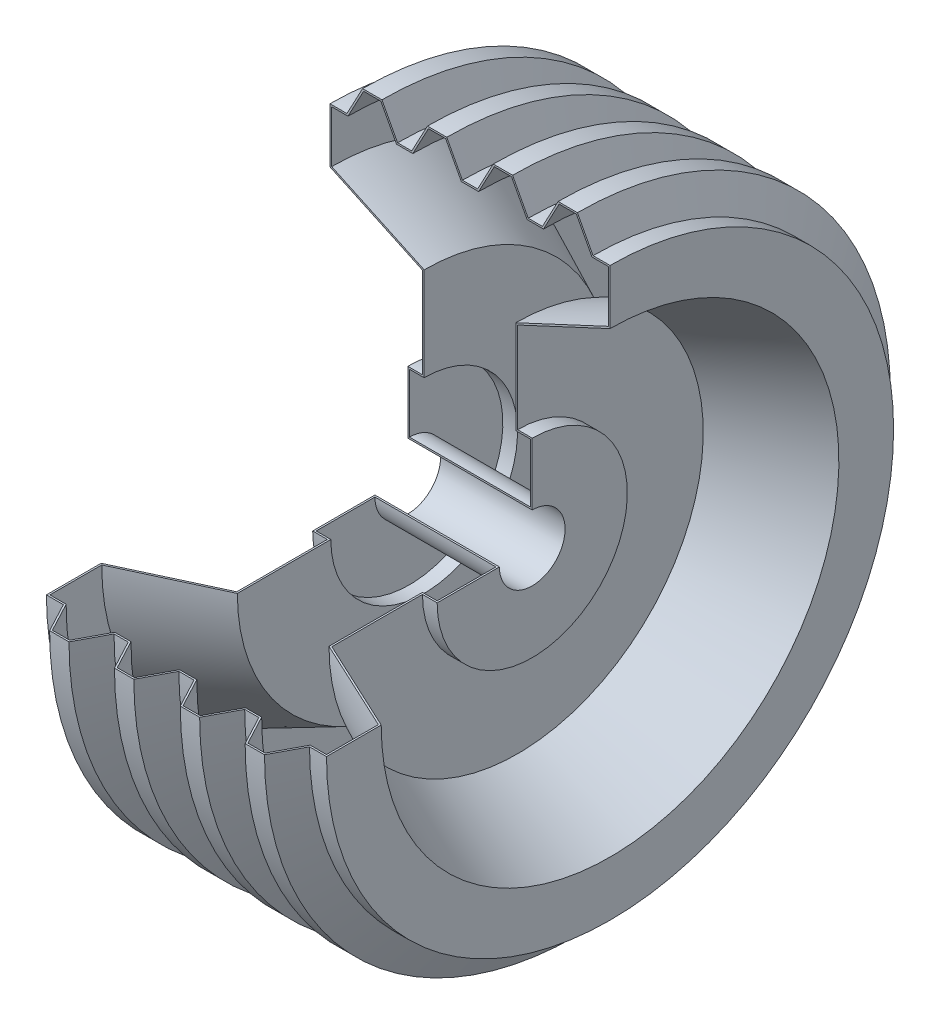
ISO-10303-21;
HEADER;
FILE_DESCRIPTION(('STEP AP214'),'2;1');
FILE_NAME('part.step','',(''),(''),'','','');
FILE_SCHEMA(('AUTOMOTIVE_DESIGN { 1 0 10303 214 1 1 1 1 }'));
ENDSEC;
DATA;
#1=APPLICATION_CONTEXT('core data for automotive mechanical design processes');
#2=APPLICATION_PROTOCOL_DEFINITION('international standard','automotive_design',2000,#1);
#3=PRODUCT_CONTEXT('',#1,'mechanical');
#4=PRODUCT('Part','Part','',(#3));
#5=PRODUCT_RELATED_PRODUCT_CATEGORY('part','',(#4));
#6=PRODUCT_DEFINITION_FORMATION('','',#4);
#7=PRODUCT_DEFINITION_CONTEXT('part definition',#1,'design');
#8=PRODUCT_DEFINITION('design','',#6,#7);
#9=PRODUCT_DEFINITION_SHAPE('','',#8);
#10=(LENGTH_UNIT() NAMED_UNIT(*) SI_UNIT(.MILLI.,.METRE.));
#11=(NAMED_UNIT(*) PLANE_ANGLE_UNIT() SI_UNIT($,.RADIAN.));
#12=(NAMED_UNIT(*) SI_UNIT($,.STERADIAN.) SOLID_ANGLE_UNIT());
#13=UNCERTAINTY_MEASURE_WITH_UNIT(LENGTH_MEASURE(1.E-05),#10,'distance_accuracy_value','');
#14=(GEOMETRIC_REPRESENTATION_CONTEXT(3) GLOBAL_UNCERTAINTY_ASSIGNED_CONTEXT((#13)) GLOBAL_UNIT_ASSIGNED_CONTEXT((#10,
#11,#12)) REPRESENTATION_CONTEXT('',''));
#15=CARTESIAN_POINT('',(0.,0.,0.));
#16=DIRECTION('',(0.,0.,1.));
#17=DIRECTION('',(1.,0.,0.));
#18=AXIS2_PLACEMENT_3D('',#15,#16,#17);
#19=CARTESIAN_POINT('',(-137.234791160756,0.,0.));
#20=DIRECTION('',(1.,0.,0.));
#21=DIRECTION('',(0.,0.,-1.));
#22=AXIS2_PLACEMENT_3D('',#19,#20,#21);
#23=CYLINDRICAL_SURFACE('',#22,55.);
#24=CARTESIAN_POINT('',(-36.,0.,0.));
#25=DIRECTION('',(1.,0.,0.));
#26=DIRECTION('',(0.,0.,-1.));
#27=AXIS2_PLACEMENT_3D('',#24,#25,#26);
#28=CIRCLE('',#27,55.);
#29=CARTESIAN_POINT('',(-36.,5.76094420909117E-13,55.));
#30=VERTEX_POINT('',#29);
#31=CARTESIAN_POINT('',(-36.,55.,0.));
#32=VERTEX_POINT('',#31);
#33=EDGE_CURVE('E11',#30,#32,#28,.T.);
#34=ORIENTED_EDGE('',*,*,#33,.T.);
#35=DIRECTION('',(-1.,0.,0.));
#36=VECTOR('',#35,1.);
#37=CARTESIAN_POINT('',(-35.,55.,0.));
#38=LINE('',#37,#36);
#39=CARTESIAN_POINT('',(-27.5,55.,0.));
#40=VERTEX_POINT('',#39);
#41=EDGE_CURVE('E391',#40,#32,#38,.T.);
#42=ORIENTED_EDGE('',*,*,#41,.F.);
#43=CARTESIAN_POINT('',(-27.5,0.,0.));
#44=DIRECTION('',(1.,0.,0.));
#45=DIRECTION('',(0.,0.,-1.));
#46=AXIS2_PLACEMENT_3D('',#43,#44,#45);
#47=CIRCLE('',#46,55.);
#48=CARTESIAN_POINT('',(-27.5,5.76094420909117E-13,55.));
#49=VERTEX_POINT('',#48);
#50=EDGE_CURVE('E781',#49,#40,#47,.T.);
#51=ORIENTED_EDGE('',*,*,#50,.F.);
#52=DIRECTION('',(-1.,0.,0.));
#53=VECTOR('',#52,1.);
#54=CARTESIAN_POINT('',(-35.,5.76094420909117E-13,55.));
#55=LINE('',#54,#53);
#56=EDGE_CURVE('E697',#49,#30,#55,.T.);
#57=ORIENTED_EDGE('',*,*,#56,.T.);
#58=EDGE_LOOP('',(#34,#42,#51,#57));
#59=FACE_BOUND('',#58,.T.);
#60=ADVANCED_FACE('F31',(#59),#23,.T.);
#61=CARTESIAN_POINT('',(-36.,2.09488880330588E-13,20.));
#62=DIRECTION('',(-1.,0.,0.));
#63=DIRECTION('',(0.,0.,1.));
#64=AXIS2_PLACEMENT_3D('',#61,#62,#63);
#65=PLANE('',#64);
#66=CARTESIAN_POINT('',(-36.,0.,0.));
#67=DIRECTION('',(1.,0.,0.));
#68=DIRECTION('',(0.,0.,-1.));
#69=AXIS2_PLACEMENT_3D('',#66,#67,#68);
#70=CIRCLE('',#69,19.);
#71=CARTESIAN_POINT('',(-36.,1.99014436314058E-13,19.));
#72=VERTEX_POINT('',#71);
#73=CARTESIAN_POINT('',(-36.,19.,0.));
#74=VERTEX_POINT('',#73);
#75=EDGE_CURVE('E39',#72,#74,#70,.T.);
#76=ORIENTED_EDGE('',*,*,#75,.T.);
#77=DIRECTION('',(0.,-1.,0.));
#78=VECTOR('',#77,1.);
#79=CARTESIAN_POINT('',(-36.,20.,0.));
#80=LINE('',#79,#78);
#81=EDGE_CURVE('E616',#32,#74,#80,.T.);
#82=ORIENTED_EDGE('',*,*,#81,.F.);
#83=ORIENTED_EDGE('',*,*,#33,.F.);
#84=DIRECTION('',(0.,0.,-1.));
#85=VECTOR('',#84,1.);
#86=CARTESIAN_POINT('',(-36.,2.09488880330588E-13,20.));
#87=LINE('',#86,#85);
#88=EDGE_CURVE('E700',#30,#72,#87,.T.);
#89=ORIENTED_EDGE('',*,*,#88,.T.);
#90=EDGE_LOOP('',(#76,#82,#83,#89));
#91=FACE_BOUND('',#90,.T.);
#92=ADVANCED_FACE('F33',(#91),#65,.T.);
#93=CARTESIAN_POINT('',(-137.234791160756,0.,0.));
#94=DIRECTION('',(1.,0.,0.));
#95=DIRECTION('',(0.,0.,-1.));
#96=AXIS2_PLACEMENT_3D('',#93,#94,#95);
#97=CYLINDRICAL_SURFACE('',#96,19.);
#98=CARTESIAN_POINT('',(36.,0.,0.));
#99=DIRECTION('',(1.,0.,0.));
#100=DIRECTION('',(0.,0.,-1.));
#101=AXIS2_PLACEMENT_3D('',#98,#99,#100);
#102=CIRCLE('',#101,19.);
#103=CARTESIAN_POINT('',(36.,1.99014436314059E-13,19.));
#104=VERTEX_POINT('',#103);
#105=CARTESIAN_POINT('',(36.,19.,0.));
#106=VERTEX_POINT('',#105);
#107=EDGE_CURVE('E831',#104,#106,#102,.T.);
#108=ORIENTED_EDGE('',*,*,#107,.T.);
#109=DIRECTION('',(1.,0.,0.));
#110=VECTOR('',#109,1.);
#111=CARTESIAN_POINT('',(-35.,19.,0.));
#112=LINE('',#111,#110);
#113=EDGE_CURVE('E619',#74,#106,#112,.T.);
#114=ORIENTED_EDGE('',*,*,#113,.F.);
#115=ORIENTED_EDGE('',*,*,#75,.F.);
#116=DIRECTION('',(1.,0.,0.));
#117=VECTOR('',#116,1.);
#118=CARTESIAN_POINT('',(-35.,1.99014436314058E-13,19.));
#119=LINE('',#118,#117);
#120=EDGE_CURVE('E703',#72,#104,#119,.T.);
#121=ORIENTED_EDGE('',*,*,#120,.T.);
#122=EDGE_LOOP('',(#108,#114,#115,#121));
#123=FACE_BOUND('',#122,.T.);
#124=ADVANCED_FACE('F840',(#123),#97,.F.);
#125=CARTESIAN_POINT('',(36.,2.09488880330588E-13,20.));
#126=DIRECTION('',(1.,0.,0.));
#127=DIRECTION('',(0.,0.,-1.));
#128=AXIS2_PLACEMENT_3D('',#125,#126,#127);
#129=PLANE('',#128);
#130=CARTESIAN_POINT('',(36.,0.,0.));
#131=DIRECTION('',(1.,0.,0.));
#132=DIRECTION('',(0.,0.,-1.));
#133=AXIS2_PLACEMENT_3D('',#130,#131,#132);
#134=CIRCLE('',#133,55.);
#135=CARTESIAN_POINT('',(36.,5.76094420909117E-13,55.));
#136=VERTEX_POINT('',#135);
#137=CARTESIAN_POINT('',(36.,55.,0.));
#138=VERTEX_POINT('',#137);
#139=EDGE_CURVE('E829',#136,#138,#134,.T.);
#140=ORIENTED_EDGE('',*,*,#139,.T.);
#141=DIRECTION('',(0.,1.,0.));
#142=VECTOR('',#141,1.);
#143=CARTESIAN_POINT('',(36.,20.,0.));
#144=LINE('',#143,#142);
#145=EDGE_CURVE('E622',#106,#138,#144,.T.);
#146=ORIENTED_EDGE('',*,*,#145,.F.);
#147=ORIENTED_EDGE('',*,*,#107,.F.);
#148=DIRECTION('',(0.,0.,1.));
#149=VECTOR('',#148,1.);
#150=CARTESIAN_POINT('',(36.,2.09488880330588E-13,20.));
#151=LINE('',#150,#149);
#152=EDGE_CURVE('E706',#104,#136,#151,.T.);
#153=ORIENTED_EDGE('',*,*,#152,.T.);
#154=EDGE_LOOP('',(#140,#146,#147,#153));
#155=FACE_BOUND('',#154,.T.);
#156=ADVANCED_FACE('F843',(#155),#129,.T.);
#157=CARTESIAN_POINT('',(-137.234791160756,0.,0.));
#158=DIRECTION('',(1.,0.,0.));
#159=DIRECTION('',(0.,0.,-1.));
#160=AXIS2_PLACEMENT_3D('',#157,#158,#159);
#161=CYLINDRICAL_SURFACE('',#160,55.);
#162=CARTESIAN_POINT('',(27.5,0.,0.));
#163=DIRECTION('',(1.,0.,0.));
#164=DIRECTION('',(0.,0.,-1.));
#165=AXIS2_PLACEMENT_3D('',#162,#163,#164);
#166=CIRCLE('',#165,55.);
#167=CARTESIAN_POINT('',(27.5,5.76094420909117E-13,55.));
#168=VERTEX_POINT('',#167);
#169=CARTESIAN_POINT('',(27.5,55.,0.));
#170=VERTEX_POINT('',#169);
#171=EDGE_CURVE('E827',#168,#170,#166,.T.);
#172=ORIENTED_EDGE('',*,*,#171,.T.);
#173=DIRECTION('',(-1.,0.,0.));
#174=VECTOR('',#173,1.);
#175=CARTESIAN_POINT('',(35.,55.,0.));
#176=LINE('',#175,#174);
#177=EDGE_CURVE('E625',#138,#170,#176,.T.);
#178=ORIENTED_EDGE('',*,*,#177,.F.);
#179=ORIENTED_EDGE('',*,*,#139,.F.);
#180=DIRECTION('',(-1.,0.,0.));
#181=VECTOR('',#180,1.);
#182=CARTESIAN_POINT('',(35.,5.76094420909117E-13,55.));
#183=LINE('',#182,#181);
#184=EDGE_CURVE('E709',#136,#168,#183,.T.);
#185=ORIENTED_EDGE('',*,*,#184,.T.);
#186=EDGE_LOOP('',(#172,#178,#179,#185));
#187=FACE_BOUND('',#186,.T.);
#188=ADVANCED_FACE('F848',(#187),#161,.T.);
#189=CARTESIAN_POINT('',(27.5,5.65619976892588E-13,54.));
#190=DIRECTION('',(1.,0.,0.));
#191=DIRECTION('',(0.,0.,-1.));
#192=AXIS2_PLACEMENT_3D('',#189,#190,#191);
#193=PLANE('',#192);
#194=CARTESIAN_POINT('',(27.5,0.,0.));
#195=DIRECTION('',(1.,0.,0.));
#196=DIRECTION('',(0.,0.,-1.));
#197=AXIS2_PLACEMENT_3D('',#194,#195,#196);
#198=CIRCLE('',#197,107.4154700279);
#199=CARTESIAN_POINT('',(27.5,1.12511732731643E-12,107.4154700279));
#200=VERTEX_POINT('',#199);
#201=CARTESIAN_POINT('',(27.5,107.4154700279,0.));
#202=VERTEX_POINT('',#201);
#203=EDGE_CURVE('E825',#200,#202,#198,.T.);
#204=ORIENTED_EDGE('',*,*,#203,.T.);
#205=DIRECTION('',(0.,1.,0.));
#206=VECTOR('',#205,1.);
#207=CARTESIAN_POINT('',(27.5,54.,0.));
#208=LINE('',#207,#206);
#209=EDGE_CURVE('E628',#170,#202,#208,.T.);
#210=ORIENTED_EDGE('',*,*,#209,.F.);
#211=ORIENTED_EDGE('',*,*,#171,.F.);
#212=DIRECTION('',(0.,0.,1.));
#213=VECTOR('',#212,1.);
#214=CARTESIAN_POINT('',(27.5,5.65619976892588E-13,54.));
#215=LINE('',#214,#213);
#216=EDGE_CURVE('E712',#168,#200,#215,.T.);
#217=ORIENTED_EDGE('',*,*,#216,.T.);
#218=EDGE_LOOP('',(#204,#210,#211,#217));
#219=FACE_BOUND('',#218,.T.);
#220=ADVANCED_FACE('F851',(#219),#193,.T.);
#221=CARTESIAN_POINT('',(27.5,0.,0.));
#222=DIRECTION('',(1.,0.,0.));
#223=DIRECTION('',(0.,0.,-1.));
#224=AXIS2_PLACEMENT_3D('',#221,#222,#223);
#225=CONICAL_SURFACE('',#224,107.4154700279,0.436332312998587);
#226=CARTESIAN_POINT('',(81.,0.,0.));
#227=DIRECTION('',(1.,0.,0.));
#228=DIRECTION('',(0.,0.,-1.));
#229=AXIS2_PLACEMENT_3D('',#226,#227,#228);
#230=CIRCLE('',#229,132.362929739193);
#231=CARTESIAN_POINT('',(81.,1.38642809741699E-12,132.362929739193));
#232=VERTEX_POINT('',#231);
#233=CARTESIAN_POINT('',(81.,132.362929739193,0.));
#234=VERTEX_POINT('',#233);
#235=EDGE_CURVE('E823',#232,#234,#230,.T.);
#236=ORIENTED_EDGE('',*,*,#235,.T.);
#237=DIRECTION('',(0.906307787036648,0.422618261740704,0.));
#238=VECTOR('',#237,1.);
#239=CARTESIAN_POINT('',(26.9226182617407,107.146232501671,0.));
#240=LINE('',#239,#238);
#241=EDGE_CURVE('E631',#202,#234,#240,.T.);
#242=ORIENTED_EDGE('',*,*,#241,.F.);
#243=ORIENTED_EDGE('',*,*,#203,.F.);
#244=DIRECTION('',(0.906307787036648,0.,0.422618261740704));
#245=VECTOR('',#244,1.);
#246=CARTESIAN_POINT('',(26.9226182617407,1.12229721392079E-12,107.146232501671));
#247=LINE('',#246,#245);
#248=EDGE_CURVE('E715',#200,#232,#247,.T.);
#249=ORIENTED_EDGE('',*,*,#248,.T.);
#250=EDGE_LOOP('',(#236,#242,#243,#249));
#251=FACE_BOUND('',#250,.T.);
#252=ADVANCED_FACE('F856',(#251),#225,.F.);
#253=CARTESIAN_POINT('',(81.,1.39310105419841E-12,133.));
#254=DIRECTION('',(1.,0.,0.));
#255=DIRECTION('',(0.,0.,-1.));
#256=AXIS2_PLACEMENT_3D('',#253,#254,#255);
#257=PLANE('',#256);
#258=CARTESIAN_POINT('',(81.,0.,0.));
#259=DIRECTION('',(1.,0.,0.));
#260=DIRECTION('',(0.,0.,-1.));
#261=AXIS2_PLACEMENT_3D('',#258,#259,#260);
#262=CIRCLE('',#261,164.);
#263=CARTESIAN_POINT('',(81.,1.71780881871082E-12,164.));
#264=VERTEX_POINT('',#263);
#265=CARTESIAN_POINT('',(81.,164.,0.));
#266=VERTEX_POINT('',#265);
#267=EDGE_CURVE('E821',#264,#266,#262,.T.);
#268=ORIENTED_EDGE('',*,*,#267,.T.);
#269=DIRECTION('',(0.,1.,0.));
#270=VECTOR('',#269,1.);
#271=CARTESIAN_POINT('',(81.,133.,0.));
#272=LINE('',#271,#270);
#273=EDGE_CURVE('E634',#234,#266,#272,.T.);
#274=ORIENTED_EDGE('',*,*,#273,.F.);
#275=ORIENTED_EDGE('',*,*,#235,.F.);
#276=DIRECTION('',(0.,0.,1.));
#277=VECTOR('',#276,1.);
#278=CARTESIAN_POINT('',(81.,1.39310105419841E-12,133.));
#279=LINE('',#278,#277);
#280=EDGE_CURVE('E718',#232,#264,#279,.T.);
#281=ORIENTED_EDGE('',*,*,#280,.T.);
#282=EDGE_LOOP('',(#268,#274,#275,#281));
#283=FACE_BOUND('',#282,.T.);
#284=ADVANCED_FACE('F859',(#283),#257,.T.);
#285=CARTESIAN_POINT('',(-137.234791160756,0.,0.));
#286=DIRECTION('',(1.,0.,0.));
#287=DIRECTION('',(0.,0.,-1.));
#288=AXIS2_PLACEMENT_3D('',#285,#286,#287);
#289=CYLINDRICAL_SURFACE('',#288,164.);
#290=CARTESIAN_POINT('',(71.1789812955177,0.,0.));
#291=DIRECTION('',(1.,0.,0.));
#292=DIRECTION('',(0.,0.,-1.));
#293=AXIS2_PLACEMENT_3D('',#290,#291,#292);
#294=CIRCLE('',#293,164.);
#295=CARTESIAN_POINT('',(71.1789812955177,1.71780881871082E-12,164.));
#296=VERTEX_POINT('',#295);
#297=CARTESIAN_POINT('',(71.1789812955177,164.,0.));
#298=VERTEX_POINT('',#297);
#299=EDGE_CURVE('E819',#296,#298,#294,.T.);
#300=ORIENTED_EDGE('',*,*,#299,.T.);
#301=DIRECTION('',(-1.,0.,0.));
#302=VECTOR('',#301,1.);
#303=CARTESIAN_POINT('',(80.,164.,0.));
#304=LINE('',#303,#302);
#305=EDGE_CURVE('E637',#266,#298,#304,.T.);
#306=ORIENTED_EDGE('',*,*,#305,.F.);
#307=ORIENTED_EDGE('',*,*,#267,.F.);
#308=DIRECTION('',(-1.,0.,0.));
#309=VECTOR('',#308,1.);
#310=CARTESIAN_POINT('',(80.,1.71780881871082E-12,164.));
#311=LINE('',#310,#309);
#312=EDGE_CURVE('E721',#264,#296,#311,.T.);
#313=ORIENTED_EDGE('',*,*,#312,.T.);
#314=EDGE_LOOP('',(#300,#306,#307,#313));
#315=FACE_BOUND('',#314,.T.);
#316=ADVANCED_FACE('F864',(#315),#289,.T.);
#317=CARTESIAN_POINT('',(71.1789812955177,0.,0.));
#318=DIRECTION('',(-1.,0.,0.));
#319=DIRECTION('',(0.,0.,1.));
#320=AXIS2_PLACEMENT_3D('',#317,#318,#319);
#321=CONICAL_SURFACE('',#320,164.,1.08210413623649);
#322=CARTESIAN_POINT('',(62.1399209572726,0.,0.));
#323=DIRECTION('',(1.,0.,0.));
#324=DIRECTION('',(0.,0.,-1.));
#325=AXIS2_PLACEMENT_3D('',#322,#323,#324);
#326=CIRCLE('',#325,181.);
#327=CARTESIAN_POINT('',(62.1399209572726,1.89587436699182E-12,181.));
#328=VERTEX_POINT('',#327);
#329=CARTESIAN_POINT('',(62.1399209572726,181.,0.));
#330=VERTEX_POINT('',#329);
#331=EDGE_CURVE('E817',#328,#330,#326,.T.);
#332=ORIENTED_EDGE('',*,*,#331,.T.);
#333=DIRECTION('',(-0.469471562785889,0.882947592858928,0.));
#334=VECTOR('',#333,1.);
#335=CARTESIAN_POINT('',(71.461068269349,163.469471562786,0.));
#336=LINE('',#335,#334);
#337=EDGE_CURVE('E640',#298,#330,#336,.T.);
#338=ORIENTED_EDGE('',*,*,#337,.F.);
#339=ORIENTED_EDGE('',*,*,#299,.F.);
#340=DIRECTION('',(-0.469471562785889,0.,0.882947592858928));
#341=VECTOR('',#340,1.);
#342=CARTESIAN_POINT('',(71.461068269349,1.71225182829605E-12,163.469471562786));
#343=LINE('',#342,#341);
#344=EDGE_CURVE('E724',#296,#328,#343,.T.);
#345=ORIENTED_EDGE('',*,*,#344,.T.);
#346=EDGE_LOOP('',(#332,#338,#339,#345));
#347=FACE_BOUND('',#346,.T.);
#348=ADVANCED_FACE('F867',(#347),#321,.T.);
#349=CARTESIAN_POINT('',(-137.234791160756,0.,0.));
#350=DIRECTION('',(1.,0.,0.));
#351=DIRECTION('',(0.,0.,-1.));
#352=AXIS2_PLACEMENT_3D('',#349,#350,#351);
#353=CYLINDRICAL_SURFACE('',#352,181.);
#354=CARTESIAN_POINT('',(50.9381997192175,0.,0.));
#355=DIRECTION('',(1.,0.,0.));
#356=DIRECTION('',(0.,0.,-1.));
#357=AXIS2_PLACEMENT_3D('',#354,#355,#356);
#358=CIRCLE('',#357,181.);
#359=CARTESIAN_POINT('',(50.9381997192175,1.89587436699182E-12,181.));
#360=VERTEX_POINT('',#359);
#361=CARTESIAN_POINT('',(50.9381997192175,181.,0.));
#362=VERTEX_POINT('',#361);
#363=EDGE_CURVE('E815',#360,#362,#358,.T.);
#364=ORIENTED_EDGE('',*,*,#363,.T.);
#365=DIRECTION('',(-1.,0.,0.));
#366=VECTOR('',#365,1.);
#367=CARTESIAN_POINT('',(61.539060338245,181.,0.));
#368=LINE('',#367,#366);
#369=EDGE_CURVE('E643',#330,#362,#368,.T.);
#370=ORIENTED_EDGE('',*,*,#369,.F.);
#371=ORIENTED_EDGE('',*,*,#331,.F.);
#372=DIRECTION('',(-1.,0.,0.));
#373=VECTOR('',#372,1.);
#374=CARTESIAN_POINT('',(61.539060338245,1.89587436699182E-12,181.));
#375=LINE('',#374,#373);
#376=EDGE_CURVE('E727',#328,#360,#375,.T.);
#377=ORIENTED_EDGE('',*,*,#376,.T.);
#378=EDGE_LOOP('',(#364,#370,#371,#377));
#379=FACE_BOUND('',#378,.T.);
#380=ADVANCED_FACE('F872',(#379),#353,.T.);
#381=CARTESIAN_POINT('',(50.9381997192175,0.,0.));
#382=DIRECTION('',(1.,0.,0.));
#383=DIRECTION('',(0.,0.,-1.));
#384=AXIS2_PLACEMENT_3D('',#381,#382,#383);
#385=CONICAL_SURFACE('',#384,181.,1.08210413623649);
#386=CARTESIAN_POINT('',(41.8991393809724,0.,0.));
#387=DIRECTION('',(1.,0.,0.));
#388=DIRECTION('',(0.,0.,-1.));
#389=AXIS2_PLACEMENT_3D('',#386,#387,#388);
#390=CIRCLE('',#389,164.);
#391=CARTESIAN_POINT('',(41.8991393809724,1.71780881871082E-12,164.));
#392=VERTEX_POINT('',#391);
#393=CARTESIAN_POINT('',(41.8991393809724,164.,0.));
#394=VERTEX_POINT('',#393);
#395=EDGE_CURVE('E813',#392,#394,#390,.T.);
#396=ORIENTED_EDGE('',*,*,#395,.T.);
#397=DIRECTION('',(-0.469471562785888,-0.882947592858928,0.));
#398=VECTOR('',#397,1.);
#399=CARTESIAN_POINT('',(50.6561127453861,180.469471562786,0.));
#400=LINE('',#399,#398);
#401=EDGE_CURVE('E646',#362,#394,#400,.T.);
#402=ORIENTED_EDGE('',*,*,#401,.F.);
#403=ORIENTED_EDGE('',*,*,#363,.F.);
#404=DIRECTION('',(-0.469471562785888,0.,-0.882947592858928));
#405=VECTOR('',#404,1.);
#406=CARTESIAN_POINT('',(50.6561127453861,1.89031737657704E-12,180.469471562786));
#407=LINE('',#406,#405);
#408=EDGE_CURVE('E730',#360,#392,#407,.T.);
#409=ORIENTED_EDGE('',*,*,#408,.T.);
#410=EDGE_LOOP('',(#396,#402,#403,#409));
#411=FACE_BOUND('',#410,.T.);
#412=ADVANCED_FACE('F875',(#411),#385,.T.);
#413=CARTESIAN_POINT('',(-137.234791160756,0.,0.));
#414=DIRECTION('',(1.,0.,0.));
#415=DIRECTION('',(0.,0.,-1.));
#416=AXIS2_PLACEMENT_3D('',#413,#414,#415);
#417=CYLINDRICAL_SURFACE('',#416,164.);
#418=CARTESIAN_POINT('',(33.6789812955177,0.,0.));
#419=DIRECTION('',(1.,0.,0.));
#420=DIRECTION('',(0.,0.,-1.));
#421=AXIS2_PLACEMENT_3D('',#418,#419,#420);
#422=CIRCLE('',#421,164.);
#423=CARTESIAN_POINT('',(33.6789812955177,1.71780881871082E-12,164.));
#424=VERTEX_POINT('',#423);
#425=CARTESIAN_POINT('',(33.6789812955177,164.,0.));
#426=VERTEX_POINT('',#425);
#427=EDGE_CURVE('E811',#424,#426,#422,.T.);
#428=ORIENTED_EDGE('',*,*,#427,.T.);
#429=DIRECTION('',(-1.,0.,0.));
#430=VECTOR('',#429,1.);
#431=CARTESIAN_POINT('',(42.5,164.,0.));
#432=LINE('',#431,#430);
#433=EDGE_CURVE('E649',#394,#426,#432,.T.);
#434=ORIENTED_EDGE('',*,*,#433,.F.);
#435=ORIENTED_EDGE('',*,*,#395,.F.);
#436=DIRECTION('',(-1.,0.,0.));
#437=VECTOR('',#436,1.);
#438=CARTESIAN_POINT('',(42.5,1.71780881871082E-12,164.));
#439=LINE('',#438,#437);
#440=EDGE_CURVE('E733',#392,#424,#439,.T.);
#441=ORIENTED_EDGE('',*,*,#440,.T.);
#442=EDGE_LOOP('',(#428,#434,#435,#441));
#443=FACE_BOUND('',#442,.T.);
#444=ADVANCED_FACE('F880',(#443),#417,.T.);
#445=CARTESIAN_POINT('',(33.6789812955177,0.,0.));
#446=DIRECTION('',(-1.,0.,0.));
#447=DIRECTION('',(0.,0.,1.));
#448=AXIS2_PLACEMENT_3D('',#445,#446,#447);
#449=CONICAL_SURFACE('',#448,164.,1.08210413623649);
#450=CARTESIAN_POINT('',(24.6399209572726,0.,0.));
#451=DIRECTION('',(1.,0.,0.));
#452=DIRECTION('',(0.,0.,-1.));
#453=AXIS2_PLACEMENT_3D('',#450,#451,#452);
#454=CIRCLE('',#453,181.);
#455=CARTESIAN_POINT('',(24.6399209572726,1.89587436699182E-12,181.));
#456=VERTEX_POINT('',#455);
#457=CARTESIAN_POINT('',(24.6399209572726,181.,0.));
#458=VERTEX_POINT('',#457);
#459=EDGE_CURVE('E809',#456,#458,#454,.T.);
#460=ORIENTED_EDGE('',*,*,#459,.T.);
#461=DIRECTION('',(-0.469471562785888,0.882947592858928,0.));
#462=VECTOR('',#461,1.);
#463=CARTESIAN_POINT('',(33.9610682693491,163.469471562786,0.));
#464=LINE('',#463,#462);
#465=EDGE_CURVE('E652',#426,#458,#464,.T.);
#466=ORIENTED_EDGE('',*,*,#465,.F.);
#467=ORIENTED_EDGE('',*,*,#427,.F.);
#468=DIRECTION('',(-0.469471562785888,0.,0.882947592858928));
#469=VECTOR('',#468,1.);
#470=CARTESIAN_POINT('',(33.9610682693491,1.71225182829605E-12,163.469471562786));
#471=LINE('',#470,#469);
#472=EDGE_CURVE('E736',#424,#456,#471,.T.);
#473=ORIENTED_EDGE('',*,*,#472,.T.);
#474=EDGE_LOOP('',(#460,#466,#467,#473));
#475=FACE_BOUND('',#474,.T.);
#476=ADVANCED_FACE('F883',(#475),#449,.T.);
#477=CARTESIAN_POINT('',(-137.234791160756,0.,0.));
#478=DIRECTION('',(1.,0.,0.));
#479=DIRECTION('',(0.,0.,-1.));
#480=AXIS2_PLACEMENT_3D('',#477,#478,#479);
#481=CYLINDRICAL_SURFACE('',#480,181.);
#482=CARTESIAN_POINT('',(13.4381997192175,0.,0.));
#483=DIRECTION('',(1.,0.,0.));
#484=DIRECTION('',(0.,0.,-1.));
#485=AXIS2_PLACEMENT_3D('',#482,#483,#484);
#486=CIRCLE('',#485,181.);
#487=CARTESIAN_POINT('',(13.4381997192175,1.89587436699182E-12,181.));
#488=VERTEX_POINT('',#487);
#489=CARTESIAN_POINT('',(13.4381997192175,181.,0.));
#490=VERTEX_POINT('',#489);
#491=EDGE_CURVE('E807',#488,#490,#486,.T.);
#492=ORIENTED_EDGE('',*,*,#491,.T.);
#493=DIRECTION('',(-1.,0.,0.));
#494=VECTOR('',#493,1.);
#495=CARTESIAN_POINT('',(24.0390603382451,181.,0.));
#496=LINE('',#495,#494);
#497=EDGE_CURVE('E655',#458,#490,#496,.T.);
#498=ORIENTED_EDGE('',*,*,#497,.F.);
#499=ORIENTED_EDGE('',*,*,#459,.F.);
#500=DIRECTION('',(-1.,0.,0.));
#501=VECTOR('',#500,1.);
#502=CARTESIAN_POINT('',(24.0390603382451,1.89587436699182E-12,181.));
#503=LINE('',#502,#501);
#504=EDGE_CURVE('E739',#456,#488,#503,.T.);
#505=ORIENTED_EDGE('',*,*,#504,.T.);
#506=EDGE_LOOP('',(#492,#498,#499,#505));
#507=FACE_BOUND('',#506,.T.);
#508=ADVANCED_FACE('F888',(#507),#481,.T.);
#509=CARTESIAN_POINT('',(13.4381997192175,0.,0.));
#510=DIRECTION('',(1.,0.,0.));
#511=DIRECTION('',(0.,0.,-1.));
#512=AXIS2_PLACEMENT_3D('',#509,#510,#511);
#513=CONICAL_SURFACE('',#512,181.,1.08210413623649);
#514=CARTESIAN_POINT('',(4.39913938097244,0.,0.));
#515=DIRECTION('',(1.,0.,0.));
#516=DIRECTION('',(0.,0.,-1.));
#517=AXIS2_PLACEMENT_3D('',#514,#515,#516);
#518=CIRCLE('',#517,164.);
#519=CARTESIAN_POINT('',(4.39913938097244,1.71780881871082E-12,164.));
#520=VERTEX_POINT('',#519);
#521=CARTESIAN_POINT('',(4.39913938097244,164.,0.));
#522=VERTEX_POINT('',#521);
#523=EDGE_CURVE('E805',#520,#522,#518,.T.);
#524=ORIENTED_EDGE('',*,*,#523,.T.);
#525=DIRECTION('',(-0.469471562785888,-0.882947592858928,0.));
#526=VECTOR('',#525,1.);
#527=CARTESIAN_POINT('',(13.1561127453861,180.469471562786,0.));
#528=LINE('',#527,#526);
#529=EDGE_CURVE('E658',#490,#522,#528,.T.);
#530=ORIENTED_EDGE('',*,*,#529,.F.);
#531=ORIENTED_EDGE('',*,*,#491,.F.);
#532=DIRECTION('',(-0.469471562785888,0.,-0.882947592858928));
#533=VECTOR('',#532,1.);
#534=CARTESIAN_POINT('',(13.1561127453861,1.89031737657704E-12,180.469471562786));
#535=LINE('',#534,#533);
#536=EDGE_CURVE('E742',#488,#520,#535,.T.);
#537=ORIENTED_EDGE('',*,*,#536,.T.);
#538=EDGE_LOOP('',(#524,#530,#531,#537));
#539=FACE_BOUND('',#538,.T.);
#540=ADVANCED_FACE('F891',(#539),#513,.T.);
#541=CARTESIAN_POINT('',(-137.234791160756,0.,0.));
#542=DIRECTION('',(1.,0.,0.));
#543=DIRECTION('',(0.,0.,-1.));
#544=AXIS2_PLACEMENT_3D('',#541,#542,#543);
#545=CYLINDRICAL_SURFACE('',#544,164.);
#546=CARTESIAN_POINT('',(-4.39913938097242,0.,0.));
#547=DIRECTION('',(1.,0.,0.));
#548=DIRECTION('',(0.,0.,-1.));
#549=AXIS2_PLACEMENT_3D('',#546,#547,#548);
#550=CIRCLE('',#549,164.);
#551=CARTESIAN_POINT('',(-4.39913938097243,1.71780881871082E-12,164.));
#552=VERTEX_POINT('',#551);
#553=CARTESIAN_POINT('',(-4.39913938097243,164.,0.));
#554=VERTEX_POINT('',#553);
#555=EDGE_CURVE('E803',#552,#554,#550,.T.);
#556=ORIENTED_EDGE('',*,*,#555,.T.);
#557=DIRECTION('',(-1.,0.,0.));
#558=VECTOR('',#557,1.);
#559=CARTESIAN_POINT('',(5.,164.,0.));
#560=LINE('',#559,#558);
#561=EDGE_CURVE('E661',#522,#554,#560,.T.);
#562=ORIENTED_EDGE('',*,*,#561,.F.);
#563=ORIENTED_EDGE('',*,*,#523,.F.);
#564=DIRECTION('',(-1.,0.,0.));
#565=VECTOR('',#564,1.);
#566=CARTESIAN_POINT('',(5.,1.71780881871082E-12,164.));
#567=LINE('',#566,#565);
#568=EDGE_CURVE('E745',#520,#552,#567,.T.);
#569=ORIENTED_EDGE('',*,*,#568,.T.);
#570=EDGE_LOOP('',(#556,#562,#563,#569));
#571=FACE_BOUND('',#570,.T.);
#572=ADVANCED_FACE('F896',(#571),#545,.T.);
#573=CARTESIAN_POINT('',(-4.39913938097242,0.,0.));
#574=DIRECTION('',(-1.,0.,0.));
#575=DIRECTION('',(0.,0.,1.));
#576=AXIS2_PLACEMENT_3D('',#573,#574,#575);
#577=CONICAL_SURFACE('',#576,164.,1.08210413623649);
#578=CARTESIAN_POINT('',(-13.4381997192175,0.,0.));
#579=DIRECTION('',(1.,0.,0.));
#580=DIRECTION('',(0.,0.,-1.));
#581=AXIS2_PLACEMENT_3D('',#578,#579,#580);
#582=CIRCLE('',#581,181.);
#583=CARTESIAN_POINT('',(-13.4381997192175,1.89587436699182E-12,181.));
#584=VERTEX_POINT('',#583);
#585=CARTESIAN_POINT('',(-13.4381997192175,181.,0.));
#586=VERTEX_POINT('',#585);
#587=EDGE_CURVE('E801',#584,#586,#582,.T.);
#588=ORIENTED_EDGE('',*,*,#587,.T.);
#589=DIRECTION('',(-0.469471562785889,0.882947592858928,0.));
#590=VECTOR('',#589,1.);
#591=CARTESIAN_POINT('',(-13.1561127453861,180.469471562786,0.));
#592=LINE('',#591,#590);
#593=EDGE_CURVE('E664',#554,#586,#592,.T.);
#594=ORIENTED_EDGE('',*,*,#593,.F.);
#595=ORIENTED_EDGE('',*,*,#555,.F.);
#596=DIRECTION('',(-0.469471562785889,0.,0.882947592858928));
#597=VECTOR('',#596,1.);
#598=CARTESIAN_POINT('',(-13.1561127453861,1.89031737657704E-12,180.469471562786));
#599=LINE('',#598,#597);
#600=EDGE_CURVE('E748',#552,#584,#599,.T.);
#601=ORIENTED_EDGE('',*,*,#600,.T.);
#602=EDGE_LOOP('',(#588,#594,#595,#601));
#603=FACE_BOUND('',#602,.T.);
#604=ADVANCED_FACE('F899',(#603),#577,.T.);
#605=CARTESIAN_POINT('',(-137.234791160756,0.,0.));
#606=DIRECTION('',(1.,0.,0.));
#607=DIRECTION('',(0.,0.,-1.));
#608=AXIS2_PLACEMENT_3D('',#605,#606,#607);
#609=CYLINDRICAL_SURFACE('',#608,181.);
#610=CARTESIAN_POINT('',(-24.6399209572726,0.,0.));
#611=DIRECTION('',(1.,0.,0.));
#612=DIRECTION('',(0.,0.,-1.));
#613=AXIS2_PLACEMENT_3D('',#610,#611,#612);
#614=CIRCLE('',#613,181.);
#615=CARTESIAN_POINT('',(-24.6399209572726,1.89587436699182E-12,181.));
#616=VERTEX_POINT('',#615);
#617=CARTESIAN_POINT('',(-24.6399209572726,181.,0.));
#618=VERTEX_POINT('',#617);
#619=EDGE_CURVE('E799',#616,#618,#614,.T.);
#620=ORIENTED_EDGE('',*,*,#619,.T.);
#621=DIRECTION('',(-1.,0.,0.));
#622=VECTOR('',#621,1.);
#623=CARTESIAN_POINT('',(-24.0390603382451,181.,0.));
#624=LINE('',#623,#622);
#625=EDGE_CURVE('E667',#586,#618,#624,.T.);
#626=ORIENTED_EDGE('',*,*,#625,.F.);
#627=ORIENTED_EDGE('',*,*,#587,.F.);
#628=DIRECTION('',(-1.,0.,0.));
#629=VECTOR('',#628,1.);
#630=CARTESIAN_POINT('',(-24.0390603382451,1.89587436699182E-12,181.));
#631=LINE('',#630,#629);
#632=EDGE_CURVE('E751',#584,#616,#631,.T.);
#633=ORIENTED_EDGE('',*,*,#632,.T.);
#634=EDGE_LOOP('',(#620,#626,#627,#633));
#635=FACE_BOUND('',#634,.T.);
#636=ADVANCED_FACE('F904',(#635),#609,.T.);
#637=CARTESIAN_POINT('',(-24.6399209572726,0.,0.));
#638=DIRECTION('',(1.,0.,0.));
#639=DIRECTION('',(0.,0.,-1.));
#640=AXIS2_PLACEMENT_3D('',#637,#638,#639);
#641=CONICAL_SURFACE('',#640,181.,1.08210413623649);
#642=CARTESIAN_POINT('',(-33.6789812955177,0.,0.));
#643=DIRECTION('',(1.,0.,0.));
#644=DIRECTION('',(0.,0.,-1.));
#645=AXIS2_PLACEMENT_3D('',#642,#643,#644);
#646=CIRCLE('',#645,164.);
#647=CARTESIAN_POINT('',(-33.6789812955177,1.71780881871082E-12,164.));
#648=VERTEX_POINT('',#647);
#649=CARTESIAN_POINT('',(-33.6789812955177,164.,0.));
#650=VERTEX_POINT('',#649);
#651=EDGE_CURVE('E797',#648,#650,#646,.T.);
#652=ORIENTED_EDGE('',*,*,#651,.T.);
#653=DIRECTION('',(-0.469471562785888,-0.882947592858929,0.));
#654=VECTOR('',#653,1.);
#655=CARTESIAN_POINT('',(-33.961068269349,163.469471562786,0.));
#656=LINE('',#655,#654);
#657=EDGE_CURVE('E670',#618,#650,#656,.T.);
#658=ORIENTED_EDGE('',*,*,#657,.F.);
#659=ORIENTED_EDGE('',*,*,#619,.F.);
#660=DIRECTION('',(-0.469471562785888,0.,-0.882947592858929));
#661=VECTOR('',#660,1.);
#662=CARTESIAN_POINT('',(-33.961068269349,1.71225182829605E-12,163.469471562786));
#663=LINE('',#662,#661);
#664=EDGE_CURVE('E754',#616,#648,#663,.T.);
#665=ORIENTED_EDGE('',*,*,#664,.T.);
#666=EDGE_LOOP('',(#652,#658,#659,#665));
#667=FACE_BOUND('',#666,.T.);
#668=ADVANCED_FACE('F907',(#667),#641,.T.);
#669=CARTESIAN_POINT('',(-137.234791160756,0.,0.));
#670=DIRECTION('',(1.,0.,0.));
#671=DIRECTION('',(0.,0.,-1.));
#672=AXIS2_PLACEMENT_3D('',#669,#670,#671);
#673=CYLINDRICAL_SURFACE('',#672,164.);
#674=CARTESIAN_POINT('',(-41.8991393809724,0.,0.));
#675=DIRECTION('',(1.,0.,0.));
#676=DIRECTION('',(0.,0.,-1.));
#677=AXIS2_PLACEMENT_3D('',#674,#675,#676);
#678=CIRCLE('',#677,164.);
#679=CARTESIAN_POINT('',(-41.8991393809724,1.71780881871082E-12,164.));
#680=VERTEX_POINT('',#679);
#681=CARTESIAN_POINT('',(-41.8991393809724,164.,0.));
#682=VERTEX_POINT('',#681);
#683=EDGE_CURVE('E795',#680,#682,#678,.T.);
#684=ORIENTED_EDGE('',*,*,#683,.T.);
#685=DIRECTION('',(-1.,0.,0.));
#686=VECTOR('',#685,1.);
#687=CARTESIAN_POINT('',(-42.4999999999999,164.,0.));
#688=LINE('',#687,#686);
#689=EDGE_CURVE('E673',#650,#682,#688,.T.);
#690=ORIENTED_EDGE('',*,*,#689,.F.);
#691=ORIENTED_EDGE('',*,*,#651,.F.);
#692=DIRECTION('',(-1.,0.,0.));
#693=VECTOR('',#692,1.);
#694=CARTESIAN_POINT('',(-42.4999999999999,1.71780881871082E-12,164.));
#695=LINE('',#694,#693);
#696=EDGE_CURVE('E757',#648,#680,#695,.T.);
#697=ORIENTED_EDGE('',*,*,#696,.T.);
#698=EDGE_LOOP('',(#684,#690,#691,#697));
#699=FACE_BOUND('',#698,.T.);
#700=ADVANCED_FACE('F912',(#699),#673,.T.);
#701=CARTESIAN_POINT('',(-41.8991393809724,0.,0.));
#702=DIRECTION('',(-1.,0.,0.));
#703=DIRECTION('',(0.,0.,1.));
#704=AXIS2_PLACEMENT_3D('',#701,#702,#703);
#705=CONICAL_SURFACE('',#704,164.,1.08210413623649);
#706=CARTESIAN_POINT('',(-50.9381997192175,0.,0.));
#707=DIRECTION('',(1.,0.,0.));
#708=DIRECTION('',(0.,0.,-1.));
#709=AXIS2_PLACEMENT_3D('',#706,#707,#708);
#710=CIRCLE('',#709,181.);
#711=CARTESIAN_POINT('',(-50.9381997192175,1.89587436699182E-12,181.));
#712=VERTEX_POINT('',#711);
#713=CARTESIAN_POINT('',(-50.9381997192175,181.,0.));
#714=VERTEX_POINT('',#713);
#715=EDGE_CURVE('E793',#712,#714,#710,.T.);
#716=ORIENTED_EDGE('',*,*,#715,.T.);
#717=DIRECTION('',(-0.469471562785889,0.882947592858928,0.));
#718=VECTOR('',#717,1.);
#719=CARTESIAN_POINT('',(-50.6561127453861,180.469471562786,0.));
#720=LINE('',#719,#718);
#721=EDGE_CURVE('E676',#682,#714,#720,.T.);
#722=ORIENTED_EDGE('',*,*,#721,.F.);
#723=ORIENTED_EDGE('',*,*,#683,.F.);
#724=DIRECTION('',(-0.469471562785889,0.,0.882947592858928));
#725=VECTOR('',#724,1.);
#726=CARTESIAN_POINT('',(-50.6561127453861,1.89031737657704E-12,180.469471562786));
#727=LINE('',#726,#725);
#728=EDGE_CURVE('E760',#680,#712,#727,.T.);
#729=ORIENTED_EDGE('',*,*,#728,.T.);
#730=EDGE_LOOP('',(#716,#722,#723,#729));
#731=FACE_BOUND('',#730,.T.);
#732=ADVANCED_FACE('F915',(#731),#705,.T.);
#733=CARTESIAN_POINT('',(-137.234791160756,0.,0.));
#734=DIRECTION('',(1.,0.,0.));
#735=DIRECTION('',(0.,0.,-1.));
#736=AXIS2_PLACEMENT_3D('',#733,#734,#735);
#737=CYLINDRICAL_SURFACE('',#736,181.);
#738=CARTESIAN_POINT('',(-62.1399209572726,0.,0.));
#739=DIRECTION('',(1.,0.,0.));
#740=DIRECTION('',(0.,0.,-1.));
#741=AXIS2_PLACEMENT_3D('',#738,#739,#740);
#742=CIRCLE('',#741,181.);
#743=CARTESIAN_POINT('',(-62.1399209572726,1.89587436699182E-12,181.));
#744=VERTEX_POINT('',#743);
#745=CARTESIAN_POINT('',(-62.1399209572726,181.,0.));
#746=VERTEX_POINT('',#745);
#747=EDGE_CURVE('E791',#744,#746,#742,.T.);
#748=ORIENTED_EDGE('',*,*,#747,.T.);
#749=DIRECTION('',(-1.,0.,0.));
#750=VECTOR('',#749,1.);
#751=CARTESIAN_POINT('',(-61.539060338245,181.,0.));
#752=LINE('',#751,#750);
#753=EDGE_CURVE('E679',#714,#746,#752,.T.);
#754=ORIENTED_EDGE('',*,*,#753,.F.);
#755=ORIENTED_EDGE('',*,*,#715,.F.);
#756=DIRECTION('',(-1.,0.,0.));
#757=VECTOR('',#756,1.);
#758=CARTESIAN_POINT('',(-61.539060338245,1.89587436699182E-12,181.));
#759=LINE('',#758,#757);
#760=EDGE_CURVE('E763',#712,#744,#759,.T.);
#761=ORIENTED_EDGE('',*,*,#760,.T.);
#762=EDGE_LOOP('',(#748,#754,#755,#761));
#763=FACE_BOUND('',#762,.T.);
#764=ADVANCED_FACE('F920',(#763),#737,.T.);
#765=CARTESIAN_POINT('',(-62.1399209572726,0.,0.));
#766=DIRECTION('',(1.,0.,0.));
#767=DIRECTION('',(0.,0.,-1.));
#768=AXIS2_PLACEMENT_3D('',#765,#766,#767);
#769=CONICAL_SURFACE('',#768,181.,1.08210413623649);
#770=CARTESIAN_POINT('',(-71.1789812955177,0.,0.));
#771=DIRECTION('',(1.,0.,0.));
#772=DIRECTION('',(0.,0.,-1.));
#773=AXIS2_PLACEMENT_3D('',#770,#771,#772);
#774=CIRCLE('',#773,164.);
#775=CARTESIAN_POINT('',(-71.1789812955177,1.71780881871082E-12,164.));
#776=VERTEX_POINT('',#775);
#777=CARTESIAN_POINT('',(-71.1789812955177,164.,0.));
#778=VERTEX_POINT('',#777);
#779=EDGE_CURVE('E789',#776,#778,#774,.T.);
#780=ORIENTED_EDGE('',*,*,#779,.T.);
#781=DIRECTION('',(-0.469471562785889,-0.882947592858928,0.));
#782=VECTOR('',#781,1.);
#783=CARTESIAN_POINT('',(-71.461068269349,163.469471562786,0.));
#784=LINE('',#783,#782);
#785=EDGE_CURVE('E682',#746,#778,#784,.T.);
#786=ORIENTED_EDGE('',*,*,#785,.F.);
#787=ORIENTED_EDGE('',*,*,#747,.F.);
#788=DIRECTION('',(-0.469471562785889,0.,-0.882947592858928));
#789=VECTOR('',#788,1.);
#790=CARTESIAN_POINT('',(-71.461068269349,1.71225182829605E-12,163.469471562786));
#791=LINE('',#790,#789);
#792=EDGE_CURVE('E766',#744,#776,#791,.T.);
#793=ORIENTED_EDGE('',*,*,#792,.T.);
#794=EDGE_LOOP('',(#780,#786,#787,#793));
#795=FACE_BOUND('',#794,.T.);
#796=ADVANCED_FACE('F923',(#795),#769,.T.);
#797=CARTESIAN_POINT('',(-137.234791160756,0.,0.));
#798=DIRECTION('',(1.,0.,0.));
#799=DIRECTION('',(0.,0.,-1.));
#800=AXIS2_PLACEMENT_3D('',#797,#798,#799);
#801=CYLINDRICAL_SURFACE('',#800,164.);
#802=CARTESIAN_POINT('',(-81.,0.,0.));
#803=DIRECTION('',(1.,0.,0.));
#804=DIRECTION('',(0.,0.,-1.));
#805=AXIS2_PLACEMENT_3D('',#802,#803,#804);
#806=CIRCLE('',#805,164.);
#807=CARTESIAN_POINT('',(-81.,1.71780881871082E-12,164.));
#808=VERTEX_POINT('',#807);
#809=CARTESIAN_POINT('',(-81.,164.,0.));
#810=VERTEX_POINT('',#809);
#811=EDGE_CURVE('E787',#808,#810,#806,.T.);
#812=ORIENTED_EDGE('',*,*,#811,.T.);
#813=DIRECTION('',(-1.,0.,0.));
#814=VECTOR('',#813,1.);
#815=CARTESIAN_POINT('',(-80.,164.,0.));
#816=LINE('',#815,#814);
#817=EDGE_CURVE('E685',#778,#810,#816,.T.);
#818=ORIENTED_EDGE('',*,*,#817,.F.);
#819=ORIENTED_EDGE('',*,*,#779,.F.);
#820=DIRECTION('',(-1.,0.,0.));
#821=VECTOR('',#820,1.);
#822=CARTESIAN_POINT('',(-80.,1.71780881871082E-12,164.));
#823=LINE('',#822,#821);
#824=EDGE_CURVE('E769',#776,#808,#823,.T.);
#825=ORIENTED_EDGE('',*,*,#824,.T.);
#826=EDGE_LOOP('',(#812,#818,#819,#825));
#827=FACE_BOUND('',#826,.T.);
#828=ADVANCED_FACE('F928',(#827),#801,.T.);
#829=CARTESIAN_POINT('',(-81.,1.39310105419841E-12,133.));
#830=DIRECTION('',(-1.,0.,0.));
#831=DIRECTION('',(0.,0.,1.));
#832=AXIS2_PLACEMENT_3D('',#829,#830,#831);
#833=PLANE('',#832);
#834=CARTESIAN_POINT('',(-81.,0.,0.));
#835=DIRECTION('',(1.,0.,0.));
#836=DIRECTION('',(0.,0.,-1.));
#837=AXIS2_PLACEMENT_3D('',#834,#835,#836);
#838=CIRCLE('',#837,132.362929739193);
#839=CARTESIAN_POINT('',(-81.,1.38642809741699E-12,132.362929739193));
#840=VERTEX_POINT('',#839);
#841=CARTESIAN_POINT('',(-81.,132.362929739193,0.));
#842=VERTEX_POINT('',#841);
#843=EDGE_CURVE('E785',#840,#842,#838,.T.);
#844=ORIENTED_EDGE('',*,*,#843,.T.);
#845=DIRECTION('',(0.,-1.,0.));
#846=VECTOR('',#845,1.);
#847=CARTESIAN_POINT('',(-81.,133.,0.));
#848=LINE('',#847,#846);
#849=EDGE_CURVE('E688',#810,#842,#848,.T.);
#850=ORIENTED_EDGE('',*,*,#849,.F.);
#851=ORIENTED_EDGE('',*,*,#811,.F.);
#852=DIRECTION('',(0.,0.,-1.));
#853=VECTOR('',#852,1.);
#854=CARTESIAN_POINT('',(-81.,1.39310105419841E-12,133.));
#855=LINE('',#854,#853);
#856=EDGE_CURVE('E772',#808,#840,#855,.T.);
#857=ORIENTED_EDGE('',*,*,#856,.T.);
#858=EDGE_LOOP('',(#844,#850,#851,#857));
#859=FACE_BOUND('',#858,.T.);
#860=ADVANCED_FACE('F931',(#859),#833,.T.);
#861=CARTESIAN_POINT('',(-81.,0.,0.));
#862=DIRECTION('',(-1.,0.,0.));
#863=DIRECTION('',(0.,0.,1.));
#864=AXIS2_PLACEMENT_3D('',#861,#862,#863);
#865=CONICAL_SURFACE('',#864,132.362929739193,0.436332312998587);
#866=CARTESIAN_POINT('',(-27.5,0.,0.));
#867=DIRECTION('',(1.,0.,0.));
#868=DIRECTION('',(0.,0.,-1.));
#869=AXIS2_PLACEMENT_3D('',#866,#867,#868);
#870=CIRCLE('',#869,107.4154700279);
#871=CARTESIAN_POINT('',(-27.5,1.12511732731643E-12,107.4154700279));
#872=VERTEX_POINT('',#871);
#873=CARTESIAN_POINT('',(-27.5,107.4154700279,0.));
#874=VERTEX_POINT('',#873);
#875=EDGE_CURVE('E783',#872,#874,#870,.T.);
#876=ORIENTED_EDGE('',*,*,#875,.T.);
#877=DIRECTION('',(0.906307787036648,-0.422618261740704,0.));
#878=VECTOR('',#877,1.);
#879=CARTESIAN_POINT('',(-26.9226182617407,107.146232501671,0.));
#880=LINE('',#879,#878);
#881=EDGE_CURVE('E691',#842,#874,#880,.T.);
#882=ORIENTED_EDGE('',*,*,#881,.F.);
#883=ORIENTED_EDGE('',*,*,#843,.F.);
#884=DIRECTION('',(0.906307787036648,0.,-0.422618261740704));
#885=VECTOR('',#884,1.);
#886=CARTESIAN_POINT('',(-26.9226182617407,1.12229721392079E-12,107.146232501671));
#887=LINE('',#886,#885);
#888=EDGE_CURVE('E775',#840,#872,#887,.T.);
#889=ORIENTED_EDGE('',*,*,#888,.T.);
#890=EDGE_LOOP('',(#876,#882,#883,#889));
#891=FACE_BOUND('',#890,.T.);
#892=ADVANCED_FACE('F936',(#891),#865,.F.);
#893=CARTESIAN_POINT('',(-27.5,5.65619976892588E-13,54.));
#894=DIRECTION('',(-1.,0.,0.));
#895=DIRECTION('',(0.,0.,1.));
#896=AXIS2_PLACEMENT_3D('',#893,#894,#895);
#897=PLANE('',#896);
#898=DIRECTION('',(0.,0.,-1.));
#899=VECTOR('',#898,1.);
#900=CARTESIAN_POINT('',(-27.5,5.65619976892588E-13,54.));
#901=LINE('',#900,#899);
#902=EDGE_CURVE('E778',#872,#49,#901,.T.);
#903=ORIENTED_EDGE('',*,*,#902,.T.);
#904=ORIENTED_EDGE('',*,*,#50,.T.);
#905=DIRECTION('',(0.,-1.,0.));
#906=VECTOR('',#905,1.);
#907=CARTESIAN_POINT('',(-27.5,54.,0.));
#908=LINE('',#907,#906);
#909=EDGE_CURVE('E694',#874,#40,#908,.T.);
#910=ORIENTED_EDGE('',*,*,#909,.F.);
#911=ORIENTED_EDGE('',*,*,#875,.F.);
#912=EDGE_LOOP('',(#903,#904,#910,#911));
#913=FACE_BOUND('',#912,.T.);
#914=ADVANCED_FACE('F939',(#913),#897,.T.);
#915=CARTESIAN_POINT('',(-36.,5.76094420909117E-13,55.));
#916=DIRECTION('',(0.,-1.,0.));
#917=DIRECTION('',(1.,0.,0.));
#918=AXIS2_PLACEMENT_3D('',#915,#916,#917);
#919=PLANE('',#918);
#920=DIRECTION('',(0.,0.,-1.));
#921=VECTOR('',#920,1.);
#922=CARTESIAN_POINT('',(-26.5,5.65619976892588E-13,54.));
#923=LINE('',#922,#921);
#924=CARTESIAN_POINT('',(-26.5,1.13179028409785E-12,108.052540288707));
#925=VERTEX_POINT('',#924);
#926=CARTESIAN_POINT('',(-26.5,5.65619976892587E-13,54.));
#927=VERTEX_POINT('',#926);
#928=EDGE_CURVE('E559',#925,#927,#923,.T.);
#929=ORIENTED_EDGE('',*,*,#928,.T.);
#930=DIRECTION('',(-1.,0.,0.));
#931=VECTOR('',#930,1.);
#932=CARTESIAN_POINT('',(-35.,5.65619976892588E-13,54.));
#933=LINE('',#932,#931);
#934=CARTESIAN_POINT('',(-35.,5.65619976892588E-13,54.));
#935=VERTEX_POINT('',#934);
#936=EDGE_CURVE('E46',#927,#935,#933,.T.);
#937=ORIENTED_EDGE('',*,*,#936,.T.);
#938=DIRECTION('',(0.,0.,-1.));
#939=VECTOR('',#938,1.);
#940=CARTESIAN_POINT('',(-35.,2.09488880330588E-13,20.));
#941=LINE('',#940,#939);
#942=CARTESIAN_POINT('',(-35.,2.09488880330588E-13,20.));
#943=VERTEX_POINT('',#942);
#944=EDGE_CURVE('E390',#935,#943,#941,.T.);
#945=ORIENTED_EDGE('',*,*,#944,.T.);
#946=DIRECTION('',(1.,0.,0.));
#947=VECTOR('',#946,1.);
#948=CARTESIAN_POINT('',(-35.,2.09488880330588E-13,20.));
#949=LINE('',#948,#947);
#950=CARTESIAN_POINT('',(35.,2.09488880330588E-13,20.));
#951=VERTEX_POINT('',#950);
#952=EDGE_CURVE('E484',#943,#951,#949,.T.);
#953=ORIENTED_EDGE('',*,*,#952,.T.);
#954=DIRECTION('',(0.,0.,1.));
#955=VECTOR('',#954,1.);
#956=CARTESIAN_POINT('',(35.,2.09488880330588E-13,20.));
#957=LINE('',#956,#955);
#958=CARTESIAN_POINT('',(35.,5.65619976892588E-13,54.));
#959=VERTEX_POINT('',#958);
#960=EDGE_CURVE('E487',#951,#959,#957,.T.);
#961=ORIENTED_EDGE('',*,*,#960,.T.);
#962=DIRECTION('',(-1.,0.,0.));
#963=VECTOR('',#962,1.);
#964=CARTESIAN_POINT('',(35.,5.65619976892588E-13,54.));
#965=LINE('',#964,#963);
#966=CARTESIAN_POINT('',(26.5,5.65619976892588E-13,54.));
#967=VERTEX_POINT('',#966);
#968=EDGE_CURVE('E490',#959,#967,#965,.T.);
#969=ORIENTED_EDGE('',*,*,#968,.T.);
#970=DIRECTION('',(0.,0.,1.));
#971=VECTOR('',#970,1.);
#972=CARTESIAN_POINT('',(26.5,5.65619976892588E-13,54.));
#973=LINE('',#972,#971);
#974=CARTESIAN_POINT('',(26.5,1.13179028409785E-12,108.052540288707));
#975=VERTEX_POINT('',#974);
#976=EDGE_CURVE('E493',#967,#975,#973,.T.);
#977=ORIENTED_EDGE('',*,*,#976,.T.);
#978=DIRECTION('',(0.906307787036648,0.,0.422618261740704));
#979=VECTOR('',#978,1.);
#980=CARTESIAN_POINT('',(26.5,1.13179028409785E-12,108.052540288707));
#981=LINE('',#980,#979);
#982=CARTESIAN_POINT('',(80.,1.39310105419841E-12,133.));
#983=VERTEX_POINT('',#982);
#984=EDGE_CURVE('E496',#975,#983,#981,.T.);
#985=ORIENTED_EDGE('',*,*,#984,.T.);
#986=DIRECTION('',(0.,0.,1.));
#987=VECTOR('',#986,1.);
#988=CARTESIAN_POINT('',(80.,1.39310105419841E-12,133.));
#989=LINE('',#988,#987);
#990=CARTESIAN_POINT('',(80.,1.70733437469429E-12,163.));
#991=VERTEX_POINT('',#990);
#992=EDGE_CURVE('E499',#983,#991,#989,.T.);
#993=ORIENTED_EDGE('',*,*,#992,.T.);
#994=DIRECTION('',(-1.,0.,0.));
#995=VECTOR('',#994,1.);
#996=CARTESIAN_POINT('',(80.,1.70733437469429E-12,163.));
#997=LINE('',#996,#995);
#998=CARTESIAN_POINT('',(70.5781206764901,1.70733437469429E-12,163.));
#999=VERTEX_POINT('',#998);
#1000=EDGE_CURVE('E502',#991,#999,#997,.T.);
#1001=ORIENTED_EDGE('',*,*,#1000,.T.);
#1002=DIRECTION('',(-0.469471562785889,0.,0.882947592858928));
#1003=VECTOR('',#1002,1.);
#1004=CARTESIAN_POINT('',(70.5781206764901,1.70733437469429E-12,163.));
#1005=LINE('',#1004,#1003);
#1006=CARTESIAN_POINT('',(61.539060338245,1.88539992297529E-12,180.));
#1007=VERTEX_POINT('',#1006);
#1008=EDGE_CURVE('E505',#999,#1007,#1005,.T.);
#1009=ORIENTED_EDGE('',*,*,#1008,.T.);
#1010=DIRECTION('',(-1.,0.,0.));
#1011=VECTOR('',#1010,1.);
#1012=CARTESIAN_POINT('',(61.539060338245,1.88539992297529E-12,180.));
#1013=LINE('',#1012,#1011);
#1014=CARTESIAN_POINT('',(51.539060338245,1.88539992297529E-12,180.));
#1015=VERTEX_POINT('',#1014);
#1016=EDGE_CURVE('E508',#1007,#1015,#1013,.T.);
#1017=ORIENTED_EDGE('',*,*,#1016,.T.);
#1018=DIRECTION('',(-0.469471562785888,0.,-0.882947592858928));
#1019=VECTOR('',#1018,1.);
#1020=CARTESIAN_POINT('',(51.539060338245,1.88539992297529E-12,180.));
#1021=LINE('',#1020,#1019);
#1022=CARTESIAN_POINT('',(42.5,1.70733437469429E-12,163.));
#1023=VERTEX_POINT('',#1022);
#1024=EDGE_CURVE('E511',#1015,#1023,#1021,.T.);
#1025=ORIENTED_EDGE('',*,*,#1024,.T.);
#1026=DIRECTION('',(-1.,0.,0.));
#1027=VECTOR('',#1026,1.);
#1028=CARTESIAN_POINT('',(42.5,1.70733437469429E-12,163.));
#1029=LINE('',#1028,#1027);
#1030=CARTESIAN_POINT('',(33.0781206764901,1.70733437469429E-12,163.));
#1031=VERTEX_POINT('',#1030);
#1032=EDGE_CURVE('E514',#1023,#1031,#1029,.T.);
#1033=ORIENTED_EDGE('',*,*,#1032,.T.);
#1034=DIRECTION('',(-0.469471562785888,0.,0.882947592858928));
#1035=VECTOR('',#1034,1.);
#1036=CARTESIAN_POINT('',(33.0781206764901,1.70733437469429E-12,163.));
#1037=LINE('',#1036,#1035);
#1038=CARTESIAN_POINT('',(24.0390603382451,1.88539992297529E-12,180.));
#1039=VERTEX_POINT('',#1038);
#1040=EDGE_CURVE('E517',#1031,#1039,#1037,.T.);
#1041=ORIENTED_EDGE('',*,*,#1040,.T.);
#1042=DIRECTION('',(-1.,0.,0.));
#1043=VECTOR('',#1042,1.);
#1044=CARTESIAN_POINT('',(24.0390603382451,1.88539992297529E-12,180.));
#1045=LINE('',#1044,#1043);
#1046=CARTESIAN_POINT('',(14.0390603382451,1.88539992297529E-12,180.));
#1047=VERTEX_POINT('',#1046);
#1048=EDGE_CURVE('E520',#1039,#1047,#1045,.T.);
#1049=ORIENTED_EDGE('',*,*,#1048,.T.);
#1050=DIRECTION('',(-0.469471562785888,0.,-0.882947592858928));
#1051=VECTOR('',#1050,1.);
#1052=CARTESIAN_POINT('',(14.0390603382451,1.88539992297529E-12,180.));
#1053=LINE('',#1052,#1051);
#1054=CARTESIAN_POINT('',(5.,1.70733437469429E-12,163.));
#1055=VERTEX_POINT('',#1054);
#1056=EDGE_CURVE('E523',#1047,#1055,#1053,.T.);
#1057=ORIENTED_EDGE('',*,*,#1056,.T.);
#1058=DIRECTION('',(-1.,0.,0.));
#1059=VECTOR('',#1058,1.);
#1060=CARTESIAN_POINT('',(5.,1.70733437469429E-12,163.));
#1061=LINE('',#1060,#1059);
#1062=CARTESIAN_POINT('',(-5.,1.70733437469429E-12,163.));
#1063=VERTEX_POINT('',#1062);
#1064=EDGE_CURVE('E526',#1055,#1063,#1061,.T.);
#1065=ORIENTED_EDGE('',*,*,#1064,.T.);
#1066=DIRECTION('',(-0.469471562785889,0.,0.882947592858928));
#1067=VECTOR('',#1066,1.);
#1068=CARTESIAN_POINT('',(-14.0390603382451,1.88539992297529E-12,180.));
#1069=LINE('',#1068,#1067);
#1070=CARTESIAN_POINT('',(-14.0390603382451,1.88539992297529E-12,180.));
#1071=VERTEX_POINT('',#1070);
#1072=EDGE_CURVE('E529',#1063,#1071,#1069,.T.);
#1073=ORIENTED_EDGE('',*,*,#1072,.T.);
#1074=DIRECTION('',(-1.,0.,0.));
#1075=VECTOR('',#1074,1.);
#1076=CARTESIAN_POINT('',(-24.0390603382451,1.88539992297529E-12,180.));
#1077=LINE('',#1076,#1075);
#1078=CARTESIAN_POINT('',(-24.0390603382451,1.88539992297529E-12,180.));
#1079=VERTEX_POINT('',#1078);
#1080=EDGE_CURVE('E532',#1071,#1079,#1077,.T.);
#1081=ORIENTED_EDGE('',*,*,#1080,.T.);
#1082=DIRECTION('',(-0.469471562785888,0.,-0.882947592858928));
#1083=VECTOR('',#1082,1.);
#1084=CARTESIAN_POINT('',(-33.0781206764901,1.70733437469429E-12,163.));
#1085=LINE('',#1084,#1083);
#1086=CARTESIAN_POINT('',(-33.0781206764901,1.70733437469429E-12,163.));
#1087=VERTEX_POINT('',#1086);
#1088=EDGE_CURVE('E535',#1079,#1087,#1085,.T.);
#1089=ORIENTED_EDGE('',*,*,#1088,.T.);
#1090=DIRECTION('',(-1.,0.,0.));
#1091=VECTOR('',#1090,1.);
#1092=CARTESIAN_POINT('',(-42.4999999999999,1.70733437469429E-12,163.));
#1093=LINE('',#1092,#1091);
#1094=CARTESIAN_POINT('',(-42.4999999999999,1.70733437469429E-12,163.));
#1095=VERTEX_POINT('',#1094);
#1096=EDGE_CURVE('E538',#1087,#1095,#1093,.T.);
#1097=ORIENTED_EDGE('',*,*,#1096,.T.);
#1098=DIRECTION('',(-0.469471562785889,0.,0.882947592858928));
#1099=VECTOR('',#1098,1.);
#1100=CARTESIAN_POINT('',(-51.539060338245,1.88539992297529E-12,180.));
#1101=LINE('',#1100,#1099);
#1102=CARTESIAN_POINT('',(-51.539060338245,1.88539992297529E-12,180.));
#1103=VERTEX_POINT('',#1102);
#1104=EDGE_CURVE('E541',#1095,#1103,#1101,.T.);
#1105=ORIENTED_EDGE('',*,*,#1104,.T.);
#1106=DIRECTION('',(-1.,0.,0.));
#1107=VECTOR('',#1106,1.);
#1108=CARTESIAN_POINT('',(-61.539060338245,1.88539992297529E-12,180.));
#1109=LINE('',#1108,#1107);
#1110=CARTESIAN_POINT('',(-61.539060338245,1.88539992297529E-12,180.));
#1111=VERTEX_POINT('',#1110);
#1112=EDGE_CURVE('E544',#1103,#1111,#1109,.T.);
#1113=ORIENTED_EDGE('',*,*,#1112,.T.);
#1114=DIRECTION('',(-0.469471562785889,0.,-0.882947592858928));
#1115=VECTOR('',#1114,1.);
#1116=CARTESIAN_POINT('',(-70.5781206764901,1.70733437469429E-12,163.));
#1117=LINE('',#1116,#1115);
#1118=CARTESIAN_POINT('',(-70.5781206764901,1.70733437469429E-12,163.));
#1119=VERTEX_POINT('',#1118);
#1120=EDGE_CURVE('E547',#1111,#1119,#1117,.T.);
#1121=ORIENTED_EDGE('',*,*,#1120,.T.);
#1122=DIRECTION('',(-1.,0.,0.));
#1123=VECTOR('',#1122,1.);
#1124=CARTESIAN_POINT('',(-80.,1.70733437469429E-12,163.));
#1125=LINE('',#1124,#1123);
#1126=CARTESIAN_POINT('',(-80.,1.70733437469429E-12,163.));
#1127=VERTEX_POINT('',#1126);
#1128=EDGE_CURVE('E550',#1119,#1127,#1125,.T.);
#1129=ORIENTED_EDGE('',*,*,#1128,.T.);
#1130=DIRECTION('',(0.,0.,-1.));
#1131=VECTOR('',#1130,1.);
#1132=CARTESIAN_POINT('',(-80.,1.39310105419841E-12,133.));
#1133=LINE('',#1132,#1131);
#1134=CARTESIAN_POINT('',(-80.,1.39310105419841E-12,133.));
#1135=VERTEX_POINT('',#1134);
#1136=EDGE_CURVE('E553',#1127,#1135,#1133,.T.);
#1137=ORIENTED_EDGE('',*,*,#1136,.T.);
#1138=DIRECTION('',(0.906307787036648,0.,-0.422618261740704));
#1139=VECTOR('',#1138,1.);
#1140=CARTESIAN_POINT('',(-26.5,1.13179028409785E-12,108.052540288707));
#1141=LINE('',#1140,#1139);
#1142=EDGE_CURVE('E556',#1135,#925,#1141,.T.);
#1143=ORIENTED_EDGE('',*,*,#1142,.T.);
#1144=EDGE_LOOP('',(#929,#937,#945,#953,#961,#969,#977,#985,#993,#1001,#1009,#1017,#1025,#1033,
#1041,#1049,#1057,#1065,#1073,#1081,#1089,#1097,#1105,#1113,#1121,#1129,#1137,#1143));
#1145=FACE_BOUND('',#1144,.T.);
#1146=ORIENTED_EDGE('',*,*,#56,.F.);
#1147=ORIENTED_EDGE('',*,*,#902,.F.);
#1148=ORIENTED_EDGE('',*,*,#888,.F.);
#1149=ORIENTED_EDGE('',*,*,#856,.F.);
#1150=ORIENTED_EDGE('',*,*,#824,.F.);
#1151=ORIENTED_EDGE('',*,*,#792,.F.);
#1152=ORIENTED_EDGE('',*,*,#760,.F.);
#1153=ORIENTED_EDGE('',*,*,#728,.F.);
#1154=ORIENTED_EDGE('',*,*,#696,.F.);
#1155=ORIENTED_EDGE('',*,*,#664,.F.);
#1156=ORIENTED_EDGE('',*,*,#632,.F.);
#1157=ORIENTED_EDGE('',*,*,#600,.F.);
#1158=ORIENTED_EDGE('',*,*,#568,.F.);
#1159=ORIENTED_EDGE('',*,*,#536,.F.);
#1160=ORIENTED_EDGE('',*,*,#504,.F.);
#1161=ORIENTED_EDGE('',*,*,#472,.F.);
#1162=ORIENTED_EDGE('',*,*,#440,.F.);
#1163=ORIENTED_EDGE('',*,*,#408,.F.);
#1164=ORIENTED_EDGE('',*,*,#376,.F.);
#1165=ORIENTED_EDGE('',*,*,#344,.F.);
#1166=ORIENTED_EDGE('',*,*,#312,.F.);
#1167=ORIENTED_EDGE('',*,*,#280,.F.);
#1168=ORIENTED_EDGE('',*,*,#248,.F.);
#1169=ORIENTED_EDGE('',*,*,#216,.F.);
#1170=ORIENTED_EDGE('',*,*,#184,.F.);
#1171=ORIENTED_EDGE('',*,*,#152,.F.);
#1172=ORIENTED_EDGE('',*,*,#120,.F.);
#1173=ORIENTED_EDGE('',*,*,#88,.F.);
#1174=EDGE_LOOP('',(#1146,#1147,#1148,#1149,#1150,#1151,#1152,#1153,#1154,#1155,#1156,#1157,
#1158,#1159,#1160,#1161,#1162,#1163,#1164,#1165,#1166,#1167,#1168,#1169,#1170,#1171,#1172,#1173));
#1175=FACE_BOUND('',#1174,.T.);
#1176=ADVANCED_FACE('F943',(#1145,#1175),#919,.F.);
#1177=CARTESIAN_POINT('',(-36.,55.,0.));
#1178=DIRECTION('',(0.,0.,1.));
#1179=DIRECTION('',(1.,0.,0.));
#1180=AXIS2_PLACEMENT_3D('',#1177,#1178,#1179);
#1181=PLANE('',#1180);
#1182=DIRECTION('',(-1.,0.,0.));
#1183=VECTOR('',#1182,1.);
#1184=CARTESIAN_POINT('',(-35.,54.,0.));
#1185=LINE('',#1184,#1183);
#1186=CARTESIAN_POINT('',(-26.5,54.,0.));
#1187=VERTEX_POINT('',#1186);
#1188=CARTESIAN_POINT('',(-35.,54.,0.));
#1189=VERTEX_POINT('',#1188);
#1190=EDGE_CURVE('E395',#1187,#1189,#1185,.T.);
#1191=ORIENTED_EDGE('',*,*,#1190,.F.);
#1192=DIRECTION('',(0.,-1.,0.));
#1193=VECTOR('',#1192,1.);
#1194=CARTESIAN_POINT('',(-26.5,54.,0.));
#1195=LINE('',#1194,#1193);
#1196=CARTESIAN_POINT('',(-26.5,108.052540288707,0.));
#1197=VERTEX_POINT('',#1196);
#1198=EDGE_CURVE('E480',#1197,#1187,#1195,.T.);
#1199=ORIENTED_EDGE('',*,*,#1198,.F.);
#1200=DIRECTION('',(0.906307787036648,-0.422618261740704,0.));
#1201=VECTOR('',#1200,1.);
#1202=CARTESIAN_POINT('',(-26.5,108.052540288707,0.));
#1203=LINE('',#1202,#1201);
#1204=CARTESIAN_POINT('',(-80.,133.,0.));
#1205=VERTEX_POINT('',#1204);
#1206=EDGE_CURVE('E54',#1205,#1197,#1203,.T.);
#1207=ORIENTED_EDGE('',*,*,#1206,.F.);
#1208=DIRECTION('',(0.,-1.,0.));
#1209=VECTOR('',#1208,1.);
#1210=CARTESIAN_POINT('',(-80.,133.,0.));
#1211=LINE('',#1210,#1209);
#1212=CARTESIAN_POINT('',(-80.,163.,0.));
#1213=VERTEX_POINT('',#1212);
#1214=EDGE_CURVE('E476',#1213,#1205,#1211,.T.);
#1215=ORIENTED_EDGE('',*,*,#1214,.F.);
#1216=DIRECTION('',(-1.,0.,0.));
#1217=VECTOR('',#1216,1.);
#1218=CARTESIAN_POINT('',(-80.,163.,0.));
#1219=LINE('',#1218,#1217);
#1220=CARTESIAN_POINT('',(-70.5781206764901,163.,0.));
#1221=VERTEX_POINT('',#1220);
#1222=EDGE_CURVE('E473',#1221,#1213,#1219,.T.);
#1223=ORIENTED_EDGE('',*,*,#1222,.F.);
#1224=DIRECTION('',(-0.469471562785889,-0.882947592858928,0.));
#1225=VECTOR('',#1224,1.);
#1226=CARTESIAN_POINT('',(-70.5781206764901,163.,0.));
#1227=LINE('',#1226,#1225);
#1228=CARTESIAN_POINT('',(-61.539060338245,180.,0.));
#1229=VERTEX_POINT('',#1228);
#1230=EDGE_CURVE('E470',#1229,#1221,#1227,.T.);
#1231=ORIENTED_EDGE('',*,*,#1230,.F.);
#1232=DIRECTION('',(-1.,0.,0.));
#1233=VECTOR('',#1232,1.);
#1234=CARTESIAN_POINT('',(-61.539060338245,180.,0.));
#1235=LINE('',#1234,#1233);
#1236=CARTESIAN_POINT('',(-51.539060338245,180.,0.));
#1237=VERTEX_POINT('',#1236);
#1238=EDGE_CURVE('E467',#1237,#1229,#1235,.T.);
#1239=ORIENTED_EDGE('',*,*,#1238,.F.);
#1240=DIRECTION('',(-0.469471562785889,0.882947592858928,0.));
#1241=VECTOR('',#1240,1.);
#1242=CARTESIAN_POINT('',(-51.539060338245,180.,0.));
#1243=LINE('',#1242,#1241);
#1244=CARTESIAN_POINT('',(-42.4999999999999,163.,0.));
#1245=VERTEX_POINT('',#1244);
#1246=EDGE_CURVE('E464',#1245,#1237,#1243,.T.);
#1247=ORIENTED_EDGE('',*,*,#1246,.F.);
#1248=DIRECTION('',(-1.,0.,0.));
#1249=VECTOR('',#1248,1.);
#1250=CARTESIAN_POINT('',(-42.4999999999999,163.,0.));
#1251=LINE('',#1250,#1249);
#1252=CARTESIAN_POINT('',(-33.0781206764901,163.,0.));
#1253=VERTEX_POINT('',#1252);
#1254=EDGE_CURVE('E461',#1253,#1245,#1251,.T.);
#1255=ORIENTED_EDGE('',*,*,#1254,.F.);
#1256=DIRECTION('',(-0.469471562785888,-0.882947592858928,0.));
#1257=VECTOR('',#1256,1.);
#1258=CARTESIAN_POINT('',(-33.0781206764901,163.,0.));
#1259=LINE('',#1258,#1257);
#1260=CARTESIAN_POINT('',(-24.0390603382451,180.,0.));
#1261=VERTEX_POINT('',#1260);
#1262=EDGE_CURVE('E458',#1261,#1253,#1259,.T.);
#1263=ORIENTED_EDGE('',*,*,#1262,.F.);
#1264=DIRECTION('',(-1.,0.,0.));
#1265=VECTOR('',#1264,1.);
#1266=CARTESIAN_POINT('',(-24.0390603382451,180.,0.));
#1267=LINE('',#1266,#1265);
#1268=CARTESIAN_POINT('',(-14.0390603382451,180.,0.));
#1269=VERTEX_POINT('',#1268);
#1270=EDGE_CURVE('E455',#1269,#1261,#1267,.T.);
#1271=ORIENTED_EDGE('',*,*,#1270,.F.);
#1272=DIRECTION('',(-0.469471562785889,0.882947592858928,0.));
#1273=VECTOR('',#1272,1.);
#1274=CARTESIAN_POINT('',(-14.0390603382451,180.,0.));
#1275=LINE('',#1274,#1273);
#1276=CARTESIAN_POINT('',(-5.,163.,0.));
#1277=VERTEX_POINT('',#1276);
#1278=EDGE_CURVE('E452',#1277,#1269,#1275,.T.);
#1279=ORIENTED_EDGE('',*,*,#1278,.F.);
#1280=DIRECTION('',(-1.,0.,0.));
#1281=VECTOR('',#1280,1.);
#1282=CARTESIAN_POINT('',(5.,163.,0.));
#1283=LINE('',#1282,#1281);
#1284=CARTESIAN_POINT('',(5.,163.,0.));
#1285=VERTEX_POINT('',#1284);
#1286=EDGE_CURVE('E449',#1285,#1277,#1283,.T.);
#1287=ORIENTED_EDGE('',*,*,#1286,.F.);
#1288=DIRECTION('',(-0.469471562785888,-0.882947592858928,0.));
#1289=VECTOR('',#1288,1.);
#1290=CARTESIAN_POINT('',(14.0390603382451,180.,0.));
#1291=LINE('',#1290,#1289);
#1292=CARTESIAN_POINT('',(14.0390603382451,180.,0.));
#1293=VERTEX_POINT('',#1292);
#1294=EDGE_CURVE('E446',#1293,#1285,#1291,.T.);
#1295=ORIENTED_EDGE('',*,*,#1294,.F.);
#1296=DIRECTION('',(-1.,0.,0.));
#1297=VECTOR('',#1296,1.);
#1298=CARTESIAN_POINT('',(24.0390603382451,180.,0.));
#1299=LINE('',#1298,#1297);
#1300=CARTESIAN_POINT('',(24.0390603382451,180.,0.));
#1301=VERTEX_POINT('',#1300);
#1302=EDGE_CURVE('E443',#1301,#1293,#1299,.T.);
#1303=ORIENTED_EDGE('',*,*,#1302,.F.);
#1304=DIRECTION('',(-0.469471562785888,0.882947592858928,0.));
#1305=VECTOR('',#1304,1.);
#1306=CARTESIAN_POINT('',(33.0781206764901,163.,0.));
#1307=LINE('',#1306,#1305);
#1308=CARTESIAN_POINT('',(33.0781206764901,163.,0.));
#1309=VERTEX_POINT('',#1308);
#1310=EDGE_CURVE('E440',#1309,#1301,#1307,.T.);
#1311=ORIENTED_EDGE('',*,*,#1310,.F.);
#1312=DIRECTION('',(-1.,0.,0.));
#1313=VECTOR('',#1312,1.);
#1314=CARTESIAN_POINT('',(42.5,163.,0.));
#1315=LINE('',#1314,#1313);
#1316=CARTESIAN_POINT('',(42.5,163.,0.));
#1317=VERTEX_POINT('',#1316);
#1318=EDGE_CURVE('E437',#1317,#1309,#1315,.T.);
#1319=ORIENTED_EDGE('',*,*,#1318,.F.);
#1320=DIRECTION('',(-0.469471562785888,-0.882947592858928,0.));
#1321=VECTOR('',#1320,1.);
#1322=CARTESIAN_POINT('',(51.539060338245,180.,0.));
#1323=LINE('',#1322,#1321);
#1324=CARTESIAN_POINT('',(51.539060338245,180.,0.));
#1325=VERTEX_POINT('',#1324);
#1326=EDGE_CURVE('E434',#1325,#1317,#1323,.T.);
#1327=ORIENTED_EDGE('',*,*,#1326,.F.);
#1328=DIRECTION('',(-1.,0.,0.));
#1329=VECTOR('',#1328,1.);
#1330=CARTESIAN_POINT('',(61.539060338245,180.,0.));
#1331=LINE('',#1330,#1329);
#1332=CARTESIAN_POINT('',(61.539060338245,180.,0.));
#1333=VERTEX_POINT('',#1332);
#1334=EDGE_CURVE('E431',#1333,#1325,#1331,.T.);
#1335=ORIENTED_EDGE('',*,*,#1334,.F.);
#1336=DIRECTION('',(-0.469471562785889,0.882947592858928,0.));
#1337=VECTOR('',#1336,1.);
#1338=CARTESIAN_POINT('',(70.5781206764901,163.,0.));
#1339=LINE('',#1338,#1337);
#1340=CARTESIAN_POINT('',(70.5781206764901,163.,0.));
#1341=VERTEX_POINT('',#1340);
#1342=EDGE_CURVE('E428',#1341,#1333,#1339,.T.);
#1343=ORIENTED_EDGE('',*,*,#1342,.F.);
#1344=DIRECTION('',(-1.,0.,0.));
#1345=VECTOR('',#1344,1.);
#1346=CARTESIAN_POINT('',(80.,163.,0.));
#1347=LINE('',#1346,#1345);
#1348=CARTESIAN_POINT('',(80.,163.,0.));
#1349=VERTEX_POINT('',#1348);
#1350=EDGE_CURVE('E425',#1349,#1341,#1347,.T.);
#1351=ORIENTED_EDGE('',*,*,#1350,.F.);
#1352=DIRECTION('',(0.,1.,0.));
#1353=VECTOR('',#1352,1.);
#1354=CARTESIAN_POINT('',(80.,133.,0.));
#1355=LINE('',#1354,#1353);
#1356=CARTESIAN_POINT('',(80.,133.,0.));
#1357=VERTEX_POINT('',#1356);
#1358=EDGE_CURVE('E422',#1357,#1349,#1355,.T.);
#1359=ORIENTED_EDGE('',*,*,#1358,.F.);
#1360=DIRECTION('',(0.906307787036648,0.422618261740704,0.));
#1361=VECTOR('',#1360,1.);
#1362=CARTESIAN_POINT('',(26.5,108.052540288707,0.));
#1363=LINE('',#1362,#1361);
#1364=CARTESIAN_POINT('',(26.5,108.052540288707,0.));
#1365=VERTEX_POINT('',#1364);
#1366=EDGE_CURVE('E419',#1365,#1357,#1363,.T.);
#1367=ORIENTED_EDGE('',*,*,#1366,.F.);
#1368=DIRECTION('',(0.,1.,0.));
#1369=VECTOR('',#1368,1.);
#1370=CARTESIAN_POINT('',(26.5,54.,0.));
#1371=LINE('',#1370,#1369);
#1372=CARTESIAN_POINT('',(26.5,54.,0.));
#1373=VERTEX_POINT('',#1372);
#1374=EDGE_CURVE('E416',#1373,#1365,#1371,.T.);
#1375=ORIENTED_EDGE('',*,*,#1374,.F.);
#1376=DIRECTION('',(-1.,0.,0.));
#1377=VECTOR('',#1376,1.);
#1378=CARTESIAN_POINT('',(35.,54.,0.));
#1379=LINE('',#1378,#1377);
#1380=CARTESIAN_POINT('',(35.,54.,0.));
#1381=VERTEX_POINT('',#1380);
#1382=EDGE_CURVE('E413',#1381,#1373,#1379,.T.);
#1383=ORIENTED_EDGE('',*,*,#1382,.F.);
#1384=DIRECTION('',(0.,1.,0.));
#1385=VECTOR('',#1384,1.);
#1386=CARTESIAN_POINT('',(35.,20.,0.));
#1387=LINE('',#1386,#1385);
#1388=CARTESIAN_POINT('',(35.,20.,0.));
#1389=VERTEX_POINT('',#1388);
#1390=EDGE_CURVE('E408',#1389,#1381,#1387,.T.);
#1391=ORIENTED_EDGE('',*,*,#1390,.F.);
#1392=DIRECTION('',(1.,0.,0.));
#1393=VECTOR('',#1392,1.);
#1394=CARTESIAN_POINT('',(-35.,20.,0.));
#1395=LINE('',#1394,#1393);
#1396=CARTESIAN_POINT('',(-35.,20.,0.));
#1397=VERTEX_POINT('',#1396);
#1398=EDGE_CURVE('E406',#1397,#1389,#1395,.T.);
#1399=ORIENTED_EDGE('',*,*,#1398,.F.);
#1400=DIRECTION('',(0.,-1.,0.));
#1401=VECTOR('',#1400,1.);
#1402=CARTESIAN_POINT('',(-35.,20.,0.));
#1403=LINE('',#1402,#1401);
#1404=EDGE_CURVE('E387',#1189,#1397,#1403,.T.);
#1405=ORIENTED_EDGE('',*,*,#1404,.F.);
#1406=EDGE_LOOP('',(#1191,#1199,#1207,#1215,#1223,#1231,#1239,#1247,#1255,#1263,#1271,#1279,
#1287,#1295,#1303,#1311,#1319,#1327,#1335,#1343,#1351,#1359,#1367,#1375,#1383,#1391,#1399,#1405));
#1407=FACE_BOUND('',#1406,.T.);
#1408=ORIENTED_EDGE('',*,*,#41,.T.);
#1409=ORIENTED_EDGE('',*,*,#81,.T.);
#1410=ORIENTED_EDGE('',*,*,#113,.T.);
#1411=ORIENTED_EDGE('',*,*,#145,.T.);
#1412=ORIENTED_EDGE('',*,*,#177,.T.);
#1413=ORIENTED_EDGE('',*,*,#209,.T.);
#1414=ORIENTED_EDGE('',*,*,#241,.T.);
#1415=ORIENTED_EDGE('',*,*,#273,.T.);
#1416=ORIENTED_EDGE('',*,*,#305,.T.);
#1417=ORIENTED_EDGE('',*,*,#337,.T.);
#1418=ORIENTED_EDGE('',*,*,#369,.T.);
#1419=ORIENTED_EDGE('',*,*,#401,.T.);
#1420=ORIENTED_EDGE('',*,*,#433,.T.);
#1421=ORIENTED_EDGE('',*,*,#465,.T.);
#1422=ORIENTED_EDGE('',*,*,#497,.T.);
#1423=ORIENTED_EDGE('',*,*,#529,.T.);
#1424=ORIENTED_EDGE('',*,*,#561,.T.);
#1425=ORIENTED_EDGE('',*,*,#593,.T.);
#1426=ORIENTED_EDGE('',*,*,#625,.T.);
#1427=ORIENTED_EDGE('',*,*,#657,.T.);
#1428=ORIENTED_EDGE('',*,*,#689,.T.);
#1429=ORIENTED_EDGE('',*,*,#721,.T.);
#1430=ORIENTED_EDGE('',*,*,#753,.T.);
#1431=ORIENTED_EDGE('',*,*,#785,.T.);
#1432=ORIENTED_EDGE('',*,*,#817,.T.);
#1433=ORIENTED_EDGE('',*,*,#849,.T.);
#1434=ORIENTED_EDGE('',*,*,#881,.T.);
#1435=ORIENTED_EDGE('',*,*,#909,.T.);
#1436=EDGE_LOOP('',(#1408,#1409,#1410,#1411,#1412,#1413,#1414,#1415,#1416,#1417,#1418,#1419,
#1420,#1421,#1422,#1423,#1424,#1425,#1426,#1427,#1428,#1429,#1430,#1431,#1432,#1433,#1434,#1435));
#1437=FACE_BOUND('',#1436,.T.);
#1438=ADVANCED_FACE('F402',(#1407,#1437),#1181,.T.);
#1439=CARTESIAN_POINT('',(-137.234791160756,0.,0.));
#1440=DIRECTION('',(1.,0.,0.));
#1441=DIRECTION('',(0.,0.,-1.));
#1442=AXIS2_PLACEMENT_3D('',#1439,#1440,#1441);
#1443=CYLINDRICAL_SURFACE('',#1442,54.);
#1444=CARTESIAN_POINT('',(-35.,0.,0.));
#1445=DIRECTION('',(1.,0.,0.));
#1446=DIRECTION('',(0.,0.,-1.));
#1447=AXIS2_PLACEMENT_3D('',#1444,#1445,#1446);
#1448=CIRCLE('',#1447,54.);
#1449=EDGE_CURVE('E383',#935,#1189,#1448,.T.);
#1450=ORIENTED_EDGE('',*,*,#1449,.F.);
#1451=ORIENTED_EDGE('',*,*,#936,.F.);
#1452=CARTESIAN_POINT('',(-26.5,0.,0.));
#1453=DIRECTION('',(1.,0.,0.));
#1454=DIRECTION('',(0.,0.,-1.));
#1455=AXIS2_PLACEMENT_3D('',#1452,#1453,#1454);
#1456=CIRCLE('',#1455,54.);
#1457=EDGE_CURVE('E397',#927,#1187,#1456,.T.);
#1458=ORIENTED_EDGE('',*,*,#1457,.T.);
#1459=ORIENTED_EDGE('',*,*,#1190,.T.);
#1460=EDGE_LOOP('',(#1450,#1451,#1458,#1459));
#1461=FACE_BOUND('',#1460,.T.);
#1462=ADVANCED_FACE('F396',(#1461),#1443,.F.);
#1463=CARTESIAN_POINT('',(-35.,2.09488880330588E-13,20.));
#1464=DIRECTION('',(-1.,0.,0.));
#1465=DIRECTION('',(0.,0.,1.));
#1466=AXIS2_PLACEMENT_3D('',#1463,#1464,#1465);
#1467=PLANE('',#1466);
#1468=CARTESIAN_POINT('',(-35.,0.,0.));
#1469=DIRECTION('',(1.,0.,0.));
#1470=DIRECTION('',(0.,0.,-1.));
#1471=AXIS2_PLACEMENT_3D('',#1468,#1469,#1470);
#1472=CIRCLE('',#1471,20.);
#1473=EDGE_CURVE('E392',#943,#1397,#1472,.T.);
#1474=ORIENTED_EDGE('',*,*,#1473,.F.);
#1475=ORIENTED_EDGE('',*,*,#944,.F.);
#1476=ORIENTED_EDGE('',*,*,#1449,.T.);
#1477=ORIENTED_EDGE('',*,*,#1404,.T.);
#1478=EDGE_LOOP('',(#1474,#1475,#1476,#1477));
#1479=FACE_BOUND('',#1478,.T.);
#1480=ADVANCED_FACE('F385',(#1479),#1467,.F.);
#1481=CARTESIAN_POINT('',(-137.234791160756,0.,0.));
#1482=DIRECTION('',(1.,0.,0.));
#1483=DIRECTION('',(0.,0.,-1.));
#1484=AXIS2_PLACEMENT_3D('',#1481,#1482,#1483);
#1485=CYLINDRICAL_SURFACE('',#1484,20.);
#1486=CARTESIAN_POINT('',(35.,0.,0.));
#1487=DIRECTION('',(1.,0.,0.));
#1488=DIRECTION('',(0.,0.,-1.));
#1489=AXIS2_PLACEMENT_3D('',#1486,#1487,#1488);
#1490=CIRCLE('',#1489,20.);
#1491=EDGE_CURVE('E611',#951,#1389,#1490,.T.);
#1492=ORIENTED_EDGE('',*,*,#1491,.F.);
#1493=ORIENTED_EDGE('',*,*,#952,.F.);
#1494=ORIENTED_EDGE('',*,*,#1473,.T.);
#1495=ORIENTED_EDGE('',*,*,#1398,.T.);
#1496=EDGE_LOOP('',(#1492,#1493,#1494,#1495));
#1497=FACE_BOUND('',#1496,.T.);
#1498=ADVANCED_FACE('F1138',(#1497),#1485,.T.);
#1499=CARTESIAN_POINT('',(35.,2.09488880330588E-13,20.));
#1500=DIRECTION('',(1.,0.,0.));
#1501=DIRECTION('',(0.,0.,-1.));
#1502=AXIS2_PLACEMENT_3D('',#1499,#1500,#1501);
#1503=PLANE('',#1502);
#1504=CARTESIAN_POINT('',(35.,0.,0.));
#1505=DIRECTION('',(1.,0.,0.));
#1506=DIRECTION('',(0.,0.,-1.));
#1507=AXIS2_PLACEMENT_3D('',#1504,#1505,#1506);
#1508=CIRCLE('',#1507,54.);
#1509=EDGE_CURVE('E609',#959,#1381,#1508,.T.);
#1510=ORIENTED_EDGE('',*,*,#1509,.F.);
#1511=ORIENTED_EDGE('',*,*,#960,.F.);
#1512=ORIENTED_EDGE('',*,*,#1491,.T.);
#1513=ORIENTED_EDGE('',*,*,#1390,.T.);
#1514=EDGE_LOOP('',(#1510,#1511,#1512,#1513));
#1515=FACE_BOUND('',#1514,.T.);
#1516=ADVANCED_FACE('F1147',(#1515),#1503,.F.);
#1517=CARTESIAN_POINT('',(-137.234791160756,0.,0.));
#1518=DIRECTION('',(1.,0.,0.));
#1519=DIRECTION('',(0.,0.,-1.));
#1520=AXIS2_PLACEMENT_3D('',#1517,#1518,#1519);
#1521=CYLINDRICAL_SURFACE('',#1520,54.);
#1522=CARTESIAN_POINT('',(26.5,0.,0.));
#1523=DIRECTION('',(1.,0.,0.));
#1524=DIRECTION('',(0.,0.,-1.));
#1525=AXIS2_PLACEMENT_3D('',#1522,#1523,#1524);
#1526=CIRCLE('',#1525,54.);
#1527=EDGE_CURVE('E607',#967,#1373,#1526,.T.);
#1528=ORIENTED_EDGE('',*,*,#1527,.F.);
#1529=ORIENTED_EDGE('',*,*,#968,.F.);
#1530=ORIENTED_EDGE('',*,*,#1509,.T.);
#1531=ORIENTED_EDGE('',*,*,#1382,.T.);
#1532=EDGE_LOOP('',(#1528,#1529,#1530,#1531));
#1533=FACE_BOUND('',#1532,.T.);
#1534=ADVANCED_FACE('F1157',(#1533),#1521,.F.);
#1535=CARTESIAN_POINT('',(26.5,5.65619976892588E-13,54.));
#1536=DIRECTION('',(1.,0.,0.));
#1537=DIRECTION('',(0.,0.,-1.));
#1538=AXIS2_PLACEMENT_3D('',#1535,#1536,#1537);
#1539=PLANE('',#1538);
#1540=CARTESIAN_POINT('',(26.5,0.,0.));
#1541=DIRECTION('',(1.,0.,0.));
#1542=DIRECTION('',(0.,0.,-1.));
#1543=AXIS2_PLACEMENT_3D('',#1540,#1541,#1542);
#1544=CIRCLE('',#1543,108.052540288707);
#1545=EDGE_CURVE('E605',#975,#1365,#1544,.T.);
#1546=ORIENTED_EDGE('',*,*,#1545,.F.);
#1547=ORIENTED_EDGE('',*,*,#976,.F.);
#1548=ORIENTED_EDGE('',*,*,#1527,.T.);
#1549=ORIENTED_EDGE('',*,*,#1374,.T.);
#1550=EDGE_LOOP('',(#1546,#1547,#1548,#1549));
#1551=FACE_BOUND('',#1550,.T.);
#1552=ADVANCED_FACE('F1167',(#1551),#1539,.F.);
#1553=CARTESIAN_POINT('',(26.5,0.,0.));
#1554=DIRECTION('',(1.,0.,0.));
#1555=DIRECTION('',(0.,0.,-1.));
#1556=AXIS2_PLACEMENT_3D('',#1553,#1554,#1555);
#1557=CONICAL_SURFACE('',#1556,108.052540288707,0.436332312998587);
#1558=CARTESIAN_POINT('',(80.,0.,0.));
#1559=DIRECTION('',(1.,0.,0.));
#1560=DIRECTION('',(0.,0.,-1.));
#1561=AXIS2_PLACEMENT_3D('',#1558,#1559,#1560);
#1562=CIRCLE('',#1561,133.);
#1563=EDGE_CURVE('E603',#983,#1357,#1562,.T.);
#1564=ORIENTED_EDGE('',*,*,#1563,.F.);
#1565=ORIENTED_EDGE('',*,*,#984,.F.);
#1566=ORIENTED_EDGE('',*,*,#1545,.T.);
#1567=ORIENTED_EDGE('',*,*,#1366,.T.);
#1568=EDGE_LOOP('',(#1564,#1565,#1566,#1567));
#1569=FACE_BOUND('',#1568,.T.);
#1570=ADVANCED_FACE('F1177',(#1569),#1557,.T.);
#1571=CARTESIAN_POINT('',(80.,1.39310105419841E-12,133.));
#1572=DIRECTION('',(1.,0.,0.));
#1573=DIRECTION('',(0.,0.,-1.));
#1574=AXIS2_PLACEMENT_3D('',#1571,#1572,#1573);
#1575=PLANE('',#1574);
#1576=CARTESIAN_POINT('',(80.,0.,0.));
#1577=DIRECTION('',(1.,0.,0.));
#1578=DIRECTION('',(0.,0.,-1.));
#1579=AXIS2_PLACEMENT_3D('',#1576,#1577,#1578);
#1580=CIRCLE('',#1579,163.);
#1581=EDGE_CURVE('E601',#991,#1349,#1580,.T.);
#1582=ORIENTED_EDGE('',*,*,#1581,.F.);
#1583=ORIENTED_EDGE('',*,*,#992,.F.);
#1584=ORIENTED_EDGE('',*,*,#1563,.T.);
#1585=ORIENTED_EDGE('',*,*,#1358,.T.);
#1586=EDGE_LOOP('',(#1582,#1583,#1584,#1585));
#1587=FACE_BOUND('',#1586,.T.);
#1588=ADVANCED_FACE('F1187',(#1587),#1575,.F.);
#1589=CARTESIAN_POINT('',(-137.234791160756,0.,0.));
#1590=DIRECTION('',(1.,0.,0.));
#1591=DIRECTION('',(0.,0.,-1.));
#1592=AXIS2_PLACEMENT_3D('',#1589,#1590,#1591);
#1593=CYLINDRICAL_SURFACE('',#1592,163.);
#1594=CARTESIAN_POINT('',(70.5781206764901,0.,0.));
#1595=DIRECTION('',(1.,0.,0.));
#1596=DIRECTION('',(0.,0.,-1.));
#1597=AXIS2_PLACEMENT_3D('',#1594,#1595,#1596);
#1598=CIRCLE('',#1597,163.);
#1599=EDGE_CURVE('E599',#999,#1341,#1598,.T.);
#1600=ORIENTED_EDGE('',*,*,#1599,.F.);
#1601=ORIENTED_EDGE('',*,*,#1000,.F.);
#1602=ORIENTED_EDGE('',*,*,#1581,.T.);
#1603=ORIENTED_EDGE('',*,*,#1350,.T.);
#1604=EDGE_LOOP('',(#1600,#1601,#1602,#1603));
#1605=FACE_BOUND('',#1604,.T.);
#1606=ADVANCED_FACE('F1197',(#1605),#1593,.F.);
#1607=CARTESIAN_POINT('',(70.5781206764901,0.,0.));
#1608=DIRECTION('',(-1.,0.,0.));
#1609=DIRECTION('',(0.,0.,1.));
#1610=AXIS2_PLACEMENT_3D('',#1607,#1608,#1609);
#1611=CONICAL_SURFACE('',#1610,163.,1.08210413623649);
#1612=CARTESIAN_POINT('',(61.539060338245,0.,0.));
#1613=DIRECTION('',(1.,0.,0.));
#1614=DIRECTION('',(0.,0.,-1.));
#1615=AXIS2_PLACEMENT_3D('',#1612,#1613,#1614);
#1616=CIRCLE('',#1615,180.);
#1617=EDGE_CURVE('E597',#1007,#1333,#1616,.T.);
#1618=ORIENTED_EDGE('',*,*,#1617,.F.);
#1619=ORIENTED_EDGE('',*,*,#1008,.F.);
#1620=ORIENTED_EDGE('',*,*,#1599,.T.);
#1621=ORIENTED_EDGE('',*,*,#1342,.T.);
#1622=EDGE_LOOP('',(#1618,#1619,#1620,#1621));
#1623=FACE_BOUND('',#1622,.T.);
#1624=ADVANCED_FACE('F1207',(#1623),#1611,.F.);
#1625=CARTESIAN_POINT('',(-137.234791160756,0.,0.));
#1626=DIRECTION('',(1.,0.,0.));
#1627=DIRECTION('',(0.,0.,-1.));
#1628=AXIS2_PLACEMENT_3D('',#1625,#1626,#1627);
#1629=CYLINDRICAL_SURFACE('',#1628,180.);
#1630=CARTESIAN_POINT('',(51.539060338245,0.,0.));
#1631=DIRECTION('',(1.,0.,0.));
#1632=DIRECTION('',(0.,0.,-1.));
#1633=AXIS2_PLACEMENT_3D('',#1630,#1631,#1632);
#1634=CIRCLE('',#1633,180.);
#1635=EDGE_CURVE('E595',#1015,#1325,#1634,.T.);
#1636=ORIENTED_EDGE('',*,*,#1635,.F.);
#1637=ORIENTED_EDGE('',*,*,#1016,.F.);
#1638=ORIENTED_EDGE('',*,*,#1617,.T.);
#1639=ORIENTED_EDGE('',*,*,#1334,.T.);
#1640=EDGE_LOOP('',(#1636,#1637,#1638,#1639));
#1641=FACE_BOUND('',#1640,.T.);
#1642=ADVANCED_FACE('F1217',(#1641),#1629,.F.);
#1643=CARTESIAN_POINT('',(51.539060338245,0.,0.));
#1644=DIRECTION('',(1.,0.,0.));
#1645=DIRECTION('',(0.,0.,-1.));
#1646=AXIS2_PLACEMENT_3D('',#1643,#1644,#1645);
#1647=CONICAL_SURFACE('',#1646,180.,1.08210413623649);
#1648=CARTESIAN_POINT('',(42.5,0.,0.));
#1649=DIRECTION('',(1.,0.,0.));
#1650=DIRECTION('',(0.,0.,-1.));
#1651=AXIS2_PLACEMENT_3D('',#1648,#1649,#1650);
#1652=CIRCLE('',#1651,163.);
#1653=EDGE_CURVE('E593',#1023,#1317,#1652,.T.);
#1654=ORIENTED_EDGE('',*,*,#1653,.F.);
#1655=ORIENTED_EDGE('',*,*,#1024,.F.);
#1656=ORIENTED_EDGE('',*,*,#1635,.T.);
#1657=ORIENTED_EDGE('',*,*,#1326,.T.);
#1658=EDGE_LOOP('',(#1654,#1655,#1656,#1657));
#1659=FACE_BOUND('',#1658,.T.);
#1660=ADVANCED_FACE('F1227',(#1659),#1647,.F.);
#1661=CARTESIAN_POINT('',(-137.234791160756,0.,0.));
#1662=DIRECTION('',(1.,0.,0.));
#1663=DIRECTION('',(0.,0.,-1.));
#1664=AXIS2_PLACEMENT_3D('',#1661,#1662,#1663);
#1665=CYLINDRICAL_SURFACE('',#1664,163.);
#1666=CARTESIAN_POINT('',(33.0781206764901,0.,0.));
#1667=DIRECTION('',(1.,0.,0.));
#1668=DIRECTION('',(0.,0.,-1.));
#1669=AXIS2_PLACEMENT_3D('',#1666,#1667,#1668);
#1670=CIRCLE('',#1669,163.);
#1671=EDGE_CURVE('E591',#1031,#1309,#1670,.T.);
#1672=ORIENTED_EDGE('',*,*,#1671,.F.);
#1673=ORIENTED_EDGE('',*,*,#1032,.F.);
#1674=ORIENTED_EDGE('',*,*,#1653,.T.);
#1675=ORIENTED_EDGE('',*,*,#1318,.T.);
#1676=EDGE_LOOP('',(#1672,#1673,#1674,#1675));
#1677=FACE_BOUND('',#1676,.T.);
#1678=ADVANCED_FACE('F1237',(#1677),#1665,.F.);
#1679=CARTESIAN_POINT('',(33.0781206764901,0.,0.));
#1680=DIRECTION('',(-1.,0.,0.));
#1681=DIRECTION('',(0.,0.,1.));
#1682=AXIS2_PLACEMENT_3D('',#1679,#1680,#1681);
#1683=CONICAL_SURFACE('',#1682,163.,1.08210413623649);
#1684=CARTESIAN_POINT('',(24.0390603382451,0.,0.));
#1685=DIRECTION('',(1.,0.,0.));
#1686=DIRECTION('',(0.,0.,-1.));
#1687=AXIS2_PLACEMENT_3D('',#1684,#1685,#1686);
#1688=CIRCLE('',#1687,180.);
#1689=EDGE_CURVE('E589',#1039,#1301,#1688,.T.);
#1690=ORIENTED_EDGE('',*,*,#1689,.F.);
#1691=ORIENTED_EDGE('',*,*,#1040,.F.);
#1692=ORIENTED_EDGE('',*,*,#1671,.T.);
#1693=ORIENTED_EDGE('',*,*,#1310,.T.);
#1694=EDGE_LOOP('',(#1690,#1691,#1692,#1693));
#1695=FACE_BOUND('',#1694,.T.);
#1696=ADVANCED_FACE('F1247',(#1695),#1683,.F.);
#1697=CARTESIAN_POINT('',(-137.234791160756,0.,0.));
#1698=DIRECTION('',(1.,0.,0.));
#1699=DIRECTION('',(0.,0.,-1.));
#1700=AXIS2_PLACEMENT_3D('',#1697,#1698,#1699);
#1701=CYLINDRICAL_SURFACE('',#1700,180.);
#1702=CARTESIAN_POINT('',(14.0390603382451,0.,0.));
#1703=DIRECTION('',(1.,0.,0.));
#1704=DIRECTION('',(0.,0.,-1.));
#1705=AXIS2_PLACEMENT_3D('',#1702,#1703,#1704);
#1706=CIRCLE('',#1705,180.);
#1707=EDGE_CURVE('E587',#1047,#1293,#1706,.T.);
#1708=ORIENTED_EDGE('',*,*,#1707,.F.);
#1709=ORIENTED_EDGE('',*,*,#1048,.F.);
#1710=ORIENTED_EDGE('',*,*,#1689,.T.);
#1711=ORIENTED_EDGE('',*,*,#1302,.T.);
#1712=EDGE_LOOP('',(#1708,#1709,#1710,#1711));
#1713=FACE_BOUND('',#1712,.T.);
#1714=ADVANCED_FACE('F1257',(#1713),#1701,.F.);
#1715=CARTESIAN_POINT('',(14.0390603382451,0.,0.));
#1716=DIRECTION('',(1.,0.,0.));
#1717=DIRECTION('',(0.,0.,-1.));
#1718=AXIS2_PLACEMENT_3D('',#1715,#1716,#1717);
#1719=CONICAL_SURFACE('',#1718,180.,1.08210413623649);
#1720=CARTESIAN_POINT('',(5.,0.,0.));
#1721=DIRECTION('',(1.,0.,0.));
#1722=DIRECTION('',(0.,0.,-1.));
#1723=AXIS2_PLACEMENT_3D('',#1720,#1721,#1722);
#1724=CIRCLE('',#1723,163.);
#1725=EDGE_CURVE('E585',#1055,#1285,#1724,.T.);
#1726=ORIENTED_EDGE('',*,*,#1725,.F.);
#1727=ORIENTED_EDGE('',*,*,#1056,.F.);
#1728=ORIENTED_EDGE('',*,*,#1707,.T.);
#1729=ORIENTED_EDGE('',*,*,#1294,.T.);
#1730=EDGE_LOOP('',(#1726,#1727,#1728,#1729));
#1731=FACE_BOUND('',#1730,.T.);
#1732=ADVANCED_FACE('F1267',(#1731),#1719,.F.);
#1733=CARTESIAN_POINT('',(-137.234791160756,0.,0.));
#1734=DIRECTION('',(1.,0.,0.));
#1735=DIRECTION('',(0.,0.,-1.));
#1736=AXIS2_PLACEMENT_3D('',#1733,#1734,#1735);
#1737=CYLINDRICAL_SURFACE('',#1736,163.);
#1738=CARTESIAN_POINT('',(-5.,0.,0.));
#1739=DIRECTION('',(1.,0.,0.));
#1740=DIRECTION('',(0.,0.,-1.));
#1741=AXIS2_PLACEMENT_3D('',#1738,#1739,#1740);
#1742=CIRCLE('',#1741,163.);
#1743=EDGE_CURVE('E583',#1063,#1277,#1742,.T.);
#1744=ORIENTED_EDGE('',*,*,#1743,.F.);
#1745=ORIENTED_EDGE('',*,*,#1064,.F.);
#1746=ORIENTED_EDGE('',*,*,#1725,.T.);
#1747=ORIENTED_EDGE('',*,*,#1286,.T.);
#1748=EDGE_LOOP('',(#1744,#1745,#1746,#1747));
#1749=FACE_BOUND('',#1748,.T.);
#1750=ADVANCED_FACE('F1277',(#1749),#1737,.F.);
#1751=CARTESIAN_POINT('',(-5.,0.,0.));
#1752=DIRECTION('',(-1.,0.,0.));
#1753=DIRECTION('',(0.,0.,1.));
#1754=AXIS2_PLACEMENT_3D('',#1751,#1752,#1753);
#1755=CONICAL_SURFACE('',#1754,163.,1.08210413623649);
#1756=CARTESIAN_POINT('',(-14.0390603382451,0.,0.));
#1757=DIRECTION('',(1.,0.,0.));
#1758=DIRECTION('',(0.,0.,-1.));
#1759=AXIS2_PLACEMENT_3D('',#1756,#1757,#1758);
#1760=CIRCLE('',#1759,180.);
#1761=EDGE_CURVE('E581',#1071,#1269,#1760,.T.);
#1762=ORIENTED_EDGE('',*,*,#1761,.F.);
#1763=ORIENTED_EDGE('',*,*,#1072,.F.);
#1764=ORIENTED_EDGE('',*,*,#1743,.T.);
#1765=ORIENTED_EDGE('',*,*,#1278,.T.);
#1766=EDGE_LOOP('',(#1762,#1763,#1764,#1765));
#1767=FACE_BOUND('',#1766,.T.);
#1768=ADVANCED_FACE('F1287',(#1767),#1755,.F.);
#1769=CARTESIAN_POINT('',(-137.234791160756,0.,0.));
#1770=DIRECTION('',(1.,0.,0.));
#1771=DIRECTION('',(0.,0.,-1.));
#1772=AXIS2_PLACEMENT_3D('',#1769,#1770,#1771);
#1773=CYLINDRICAL_SURFACE('',#1772,180.);
#1774=CARTESIAN_POINT('',(-24.0390603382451,0.,0.));
#1775=DIRECTION('',(1.,0.,0.));
#1776=DIRECTION('',(0.,0.,-1.));
#1777=AXIS2_PLACEMENT_3D('',#1774,#1775,#1776);
#1778=CIRCLE('',#1777,180.);
#1779=EDGE_CURVE('E579',#1079,#1261,#1778,.T.);
#1780=ORIENTED_EDGE('',*,*,#1779,.F.);
#1781=ORIENTED_EDGE('',*,*,#1080,.F.);
#1782=ORIENTED_EDGE('',*,*,#1761,.T.);
#1783=ORIENTED_EDGE('',*,*,#1270,.T.);
#1784=EDGE_LOOP('',(#1780,#1781,#1782,#1783));
#1785=FACE_BOUND('',#1784,.T.);
#1786=ADVANCED_FACE('F1297',(#1785),#1773,.F.);
#1787=CARTESIAN_POINT('',(-24.0390603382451,0.,0.));
#1788=DIRECTION('',(1.,0.,0.));
#1789=DIRECTION('',(0.,0.,-1.));
#1790=AXIS2_PLACEMENT_3D('',#1787,#1788,#1789);
#1791=CONICAL_SURFACE('',#1790,180.,1.08210413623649);
#1792=CARTESIAN_POINT('',(-33.0781206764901,0.,0.));
#1793=DIRECTION('',(1.,0.,0.));
#1794=DIRECTION('',(0.,0.,-1.));
#1795=AXIS2_PLACEMENT_3D('',#1792,#1793,#1794);
#1796=CIRCLE('',#1795,163.);
#1797=EDGE_CURVE('E577',#1087,#1253,#1796,.T.);
#1798=ORIENTED_EDGE('',*,*,#1797,.F.);
#1799=ORIENTED_EDGE('',*,*,#1088,.F.);
#1800=ORIENTED_EDGE('',*,*,#1779,.T.);
#1801=ORIENTED_EDGE('',*,*,#1262,.T.);
#1802=EDGE_LOOP('',(#1798,#1799,#1800,#1801));
#1803=FACE_BOUND('',#1802,.T.);
#1804=ADVANCED_FACE('F1307',(#1803),#1791,.F.);
#1805=CARTESIAN_POINT('',(-137.234791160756,0.,0.));
#1806=DIRECTION('',(1.,0.,0.));
#1807=DIRECTION('',(0.,0.,-1.));
#1808=AXIS2_PLACEMENT_3D('',#1805,#1806,#1807);
#1809=CYLINDRICAL_SURFACE('',#1808,163.);
#1810=CARTESIAN_POINT('',(-42.4999999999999,0.,0.));
#1811=DIRECTION('',(1.,0.,0.));
#1812=DIRECTION('',(0.,0.,-1.));
#1813=AXIS2_PLACEMENT_3D('',#1810,#1811,#1812);
#1814=CIRCLE('',#1813,163.);
#1815=EDGE_CURVE('E575',#1095,#1245,#1814,.T.);
#1816=ORIENTED_EDGE('',*,*,#1815,.F.);
#1817=ORIENTED_EDGE('',*,*,#1096,.F.);
#1818=ORIENTED_EDGE('',*,*,#1797,.T.);
#1819=ORIENTED_EDGE('',*,*,#1254,.T.);
#1820=EDGE_LOOP('',(#1816,#1817,#1818,#1819));
#1821=FACE_BOUND('',#1820,.T.);
#1822=ADVANCED_FACE('F1317',(#1821),#1809,.F.);
#1823=CARTESIAN_POINT('',(-42.4999999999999,0.,0.));
#1824=DIRECTION('',(-1.,0.,0.));
#1825=DIRECTION('',(0.,0.,1.));
#1826=AXIS2_PLACEMENT_3D('',#1823,#1824,#1825);
#1827=CONICAL_SURFACE('',#1826,163.,1.08210413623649);
#1828=CARTESIAN_POINT('',(-51.539060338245,0.,0.));
#1829=DIRECTION('',(1.,0.,0.));
#1830=DIRECTION('',(0.,0.,-1.));
#1831=AXIS2_PLACEMENT_3D('',#1828,#1829,#1830);
#1832=CIRCLE('',#1831,180.);
#1833=EDGE_CURVE('E573',#1103,#1237,#1832,.T.);
#1834=ORIENTED_EDGE('',*,*,#1833,.F.);
#1835=ORIENTED_EDGE('',*,*,#1104,.F.);
#1836=ORIENTED_EDGE('',*,*,#1815,.T.);
#1837=ORIENTED_EDGE('',*,*,#1246,.T.);
#1838=EDGE_LOOP('',(#1834,#1835,#1836,#1837));
#1839=FACE_BOUND('',#1838,.T.);
#1840=ADVANCED_FACE('F1327',(#1839),#1827,.F.);
#1841=CARTESIAN_POINT('',(-137.234791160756,0.,0.));
#1842=DIRECTION('',(1.,0.,0.));
#1843=DIRECTION('',(0.,0.,-1.));
#1844=AXIS2_PLACEMENT_3D('',#1841,#1842,#1843);
#1845=CYLINDRICAL_SURFACE('',#1844,180.);
#1846=CARTESIAN_POINT('',(-61.539060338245,0.,0.));
#1847=DIRECTION('',(1.,0.,0.));
#1848=DIRECTION('',(0.,0.,-1.));
#1849=AXIS2_PLACEMENT_3D('',#1846,#1847,#1848);
#1850=CIRCLE('',#1849,180.);
#1851=EDGE_CURVE('E571',#1111,#1229,#1850,.T.);
#1852=ORIENTED_EDGE('',*,*,#1851,.F.);
#1853=ORIENTED_EDGE('',*,*,#1112,.F.);
#1854=ORIENTED_EDGE('',*,*,#1833,.T.);
#1855=ORIENTED_EDGE('',*,*,#1238,.T.);
#1856=EDGE_LOOP('',(#1852,#1853,#1854,#1855));
#1857=FACE_BOUND('',#1856,.T.);
#1858=ADVANCED_FACE('F1337',(#1857),#1845,.F.);
#1859=CARTESIAN_POINT('',(-61.539060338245,0.,0.));
#1860=DIRECTION('',(1.,0.,0.));
#1861=DIRECTION('',(0.,0.,-1.));
#1862=AXIS2_PLACEMENT_3D('',#1859,#1860,#1861);
#1863=CONICAL_SURFACE('',#1862,180.,1.08210413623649);
#1864=CARTESIAN_POINT('',(-70.5781206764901,0.,0.));
#1865=DIRECTION('',(1.,0.,0.));
#1866=DIRECTION('',(0.,0.,-1.));
#1867=AXIS2_PLACEMENT_3D('',#1864,#1865,#1866);
#1868=CIRCLE('',#1867,163.);
#1869=EDGE_CURVE('E569',#1119,#1221,#1868,.T.);
#1870=ORIENTED_EDGE('',*,*,#1869,.F.);
#1871=ORIENTED_EDGE('',*,*,#1120,.F.);
#1872=ORIENTED_EDGE('',*,*,#1851,.T.);
#1873=ORIENTED_EDGE('',*,*,#1230,.T.);
#1874=EDGE_LOOP('',(#1870,#1871,#1872,#1873));
#1875=FACE_BOUND('',#1874,.T.);
#1876=ADVANCED_FACE('F1347',(#1875),#1863,.F.);
#1877=CARTESIAN_POINT('',(-137.234791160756,0.,0.));
#1878=DIRECTION('',(1.,0.,0.));
#1879=DIRECTION('',(0.,0.,-1.));
#1880=AXIS2_PLACEMENT_3D('',#1877,#1878,#1879);
#1881=CYLINDRICAL_SURFACE('',#1880,163.);
#1882=CARTESIAN_POINT('',(-80.,0.,0.));
#1883=DIRECTION('',(1.,0.,0.));
#1884=DIRECTION('',(0.,0.,-1.));
#1885=AXIS2_PLACEMENT_3D('',#1882,#1883,#1884);
#1886=CIRCLE('',#1885,163.);
#1887=EDGE_CURVE('E567',#1127,#1213,#1886,.T.);
#1888=ORIENTED_EDGE('',*,*,#1887,.F.);
#1889=ORIENTED_EDGE('',*,*,#1128,.F.);
#1890=ORIENTED_EDGE('',*,*,#1869,.T.);
#1891=ORIENTED_EDGE('',*,*,#1222,.T.);
#1892=EDGE_LOOP('',(#1888,#1889,#1890,#1891));
#1893=FACE_BOUND('',#1892,.T.);
#1894=ADVANCED_FACE('F1357',(#1893),#1881,.F.);
#1895=CARTESIAN_POINT('',(-80.,1.39310105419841E-12,133.));
#1896=DIRECTION('',(-1.,0.,0.));
#1897=DIRECTION('',(0.,0.,1.));
#1898=AXIS2_PLACEMENT_3D('',#1895,#1896,#1897);
#1899=PLANE('',#1898);
#1900=CARTESIAN_POINT('',(-80.,0.,0.));
#1901=DIRECTION('',(1.,0.,0.));
#1902=DIRECTION('',(0.,0.,-1.));
#1903=AXIS2_PLACEMENT_3D('',#1900,#1901,#1902);
#1904=CIRCLE('',#1903,133.);
#1905=EDGE_CURVE('E565',#1135,#1205,#1904,.T.);
#1906=ORIENTED_EDGE('',*,*,#1905,.F.);
#1907=ORIENTED_EDGE('',*,*,#1136,.F.);
#1908=ORIENTED_EDGE('',*,*,#1887,.T.);
#1909=ORIENTED_EDGE('',*,*,#1214,.T.);
#1910=EDGE_LOOP('',(#1906,#1907,#1908,#1909));
#1911=FACE_BOUND('',#1910,.T.);
#1912=ADVANCED_FACE('F1367',(#1911),#1899,.F.);
#1913=CARTESIAN_POINT('',(-80.,0.,0.));
#1914=DIRECTION('',(-1.,0.,0.));
#1915=DIRECTION('',(0.,0.,1.));
#1916=AXIS2_PLACEMENT_3D('',#1913,#1914,#1915);
#1917=CONICAL_SURFACE('',#1916,133.,0.436332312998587);
#1918=CARTESIAN_POINT('',(-26.5,0.,0.));
#1919=DIRECTION('',(1.,0.,0.));
#1920=DIRECTION('',(0.,0.,-1.));
#1921=AXIS2_PLACEMENT_3D('',#1918,#1919,#1920);
#1922=CIRCLE('',#1921,108.052540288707);
#1923=EDGE_CURVE('E563',#925,#1197,#1922,.T.);
#1924=ORIENTED_EDGE('',*,*,#1923,.F.);
#1925=ORIENTED_EDGE('',*,*,#1142,.F.);
#1926=ORIENTED_EDGE('',*,*,#1905,.T.);
#1927=ORIENTED_EDGE('',*,*,#1206,.T.);
#1928=EDGE_LOOP('',(#1924,#1925,#1926,#1927));
#1929=FACE_BOUND('',#1928,.T.);
#1930=ADVANCED_FACE('F1377',(#1929),#1917,.T.);
#1931=CARTESIAN_POINT('',(-26.5,5.65619976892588E-13,54.));
#1932=DIRECTION('',(-1.,0.,0.));
#1933=DIRECTION('',(0.,0.,1.));
#1934=AXIS2_PLACEMENT_3D('',#1931,#1932,#1933);
#1935=PLANE('',#1934);
#1936=ORIENTED_EDGE('',*,*,#928,.F.);
#1937=ORIENTED_EDGE('',*,*,#1923,.T.);
#1938=ORIENTED_EDGE('',*,*,#1198,.T.);
#1939=ORIENTED_EDGE('',*,*,#1457,.F.);
#1940=EDGE_LOOP('',(#1936,#1937,#1938,#1939));
#1941=FACE_BOUND('',#1940,.T.);
#1942=ADVANCED_FACE('F1387',(#1941),#1935,.F.);
#1943=CLOSED_SHELL('',(#60,#92,#124,#156,#188,#220,#252,#284,#316,#348,#380,#412,#444,#476,#508,
#540,#572,#604,#636,#668,#700,#732,#764,#796,#828,#860,#892,#914,#1176,#1438,#1462,#1480,#1498,
#1516,#1534,#1552,#1570,#1588,#1606,#1624,#1642,#1660,#1678,#1696,#1714,#1732,#1750,#1768,#1786,
#1804,#1822,#1840,#1858,#1876,#1894,#1912,#1930,#1942));
#1944=MANIFOLD_SOLID_BREP('B2',#1943);
#1945=ADVANCED_BREP_SHAPE_REPRESENTATION('',(#18,#1944),#14);
#1946=SHAPE_DEFINITION_REPRESENTATION(#9,#1945);
ENDSEC;
END-ISO-10303-21;
